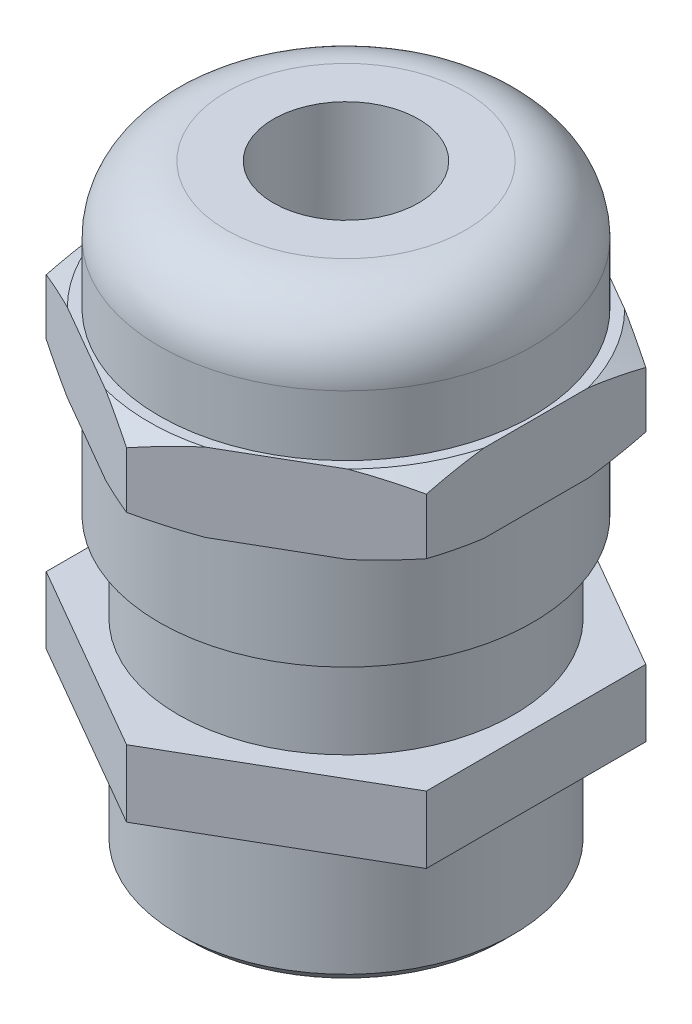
ISO-10303-21;
HEADER;
FILE_DESCRIPTION(('STEP AP214'),'2;1');
FILE_NAME('part.step','',(''),(''),'','','');
FILE_SCHEMA(('AUTOMOTIVE_DESIGN { 1 0 10303 214 1 1 1 1 }'));
ENDSEC;
DATA;
#1=APPLICATION_CONTEXT('core data for automotive mechanical design processes');
#2=APPLICATION_PROTOCOL_DEFINITION('international standard','automotive_design',2000,#1);
#3=PRODUCT_CONTEXT('',#1,'mechanical');
#4=PRODUCT('Part','Part','',(#3));
#5=PRODUCT_RELATED_PRODUCT_CATEGORY('part','',(#4));
#6=PRODUCT_DEFINITION_FORMATION('','',#4);
#7=PRODUCT_DEFINITION_CONTEXT('part definition',#1,'design');
#8=PRODUCT_DEFINITION('design','',#6,#7);
#9=PRODUCT_DEFINITION_SHAPE('','',#8);
#10=(LENGTH_UNIT() NAMED_UNIT(*) SI_UNIT(.MILLI.,.METRE.));
#11=(NAMED_UNIT(*) PLANE_ANGLE_UNIT() SI_UNIT($,.RADIAN.));
#12=(NAMED_UNIT(*) SI_UNIT($,.STERADIAN.) SOLID_ANGLE_UNIT());
#13=UNCERTAINTY_MEASURE_WITH_UNIT(LENGTH_MEASURE(1.E-05),#10,'distance_accuracy_value','');
#14=(GEOMETRIC_REPRESENTATION_CONTEXT(3) GLOBAL_UNCERTAINTY_ASSIGNED_CONTEXT((#13)) GLOBAL_UNIT_ASSIGNED_CONTEXT((#10,
#11,#12)) REPRESENTATION_CONTEXT('',''));
#15=CARTESIAN_POINT('',(0.,0.,0.));
#16=DIRECTION('',(0.,0.,1.));
#17=DIRECTION('',(1.,0.,0.));
#18=AXIS2_PLACEMENT_3D('',#15,#16,#17);
#19=CARTESIAN_POINT('',(0.,20.7,0.));
#20=DIRECTION('',(0.,1.,0.));
#21=DIRECTION('',(0.,0.,1.));
#22=AXIS2_PLACEMENT_3D('',#19,#20,#21);
#23=CYLINDRICAL_SURFACE('',#22,3.25000000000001);
#24=CARTESIAN_POINT('',(0.,20.7,0.));
#25=DIRECTION('',(0.,1.,0.));
#26=DIRECTION('',(0.,0.,1.));
#27=AXIS2_PLACEMENT_3D('',#24,#25,#26);
#28=CIRCLE('',#27,3.25000000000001);
#29=CARTESIAN_POINT('',(0.,20.7,3.25000000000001));
#30=VERTEX_POINT('',#29);
#31=EDGE_CURVE('E379',#30,#30,#28,.T.);
#32=ORIENTED_EDGE('',*,*,#31,.T.);
#33=EDGE_LOOP('',(#32));
#34=FACE_BOUND('',#33,.T.);
#35=CARTESIAN_POINT('',(0.,14.,0.));
#36=DIRECTION('',(0.,-1.,0.));
#37=DIRECTION('',(0.,0.,-1.));
#38=AXIS2_PLACEMENT_3D('',#35,#36,#37);
#39=CIRCLE('',#38,3.25000000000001);
#40=CARTESIAN_POINT('',(0.,14.,-3.25000000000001));
#41=VERTEX_POINT('',#40);
#42=EDGE_CURVE('E36',#41,#41,#39,.F.);
#43=ORIENTED_EDGE('',*,*,#42,.F.);
#44=EDGE_LOOP('',(#43));
#45=FACE_BOUND('',#44,.T.);
#46=ADVANCED_FACE('F32',(#34,#45),#23,.F.);
#47=CARTESIAN_POINT('',(8.5,15.,-4.90747728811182));
#48=DIRECTION('',(1.,0.,0.));
#49=DIRECTION('',(0.,0.,-1.));
#50=AXIS2_PLACEMENT_3D('',#47,#48,#49);
#51=PLANE('',#50);
#52=DIRECTION('',(0.,-1.,0.));
#53=VECTOR('',#52,1.);
#54=CARTESIAN_POINT('',(8.50000000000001,15.,4.90747728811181));
#55=LINE('',#54,#53);
#56=CARTESIAN_POINT('',(8.50000000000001,14.5,4.90747728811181));
#57=VERTEX_POINT('',#56);
#58=CARTESIAN_POINT('',(8.50000000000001,12.,4.90747728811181));
#59=VERTEX_POINT('',#58);
#60=EDGE_CURVE('E231',#57,#59,#55,.T.);
#61=ORIENTED_EDGE('',*,*,#60,.T.);
#62=CARTESIAN_POINT('',(8.50000000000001,13.9660699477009,10.804286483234));
#63=CARTESIAN_POINT('',(8.50000000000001,13.8311262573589,10.4607659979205));
#64=CARTESIAN_POINT('',(8.50000000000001,13.6982273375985,10.116422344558));
#65=CARTESIAN_POINT('',(8.50000000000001,13.4376310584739,9.42569184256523));
#66=CARTESIAN_POINT('',(8.50000000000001,13.3099348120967,9.07930457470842));
#67=CARTESIAN_POINT('',(8.50000000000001,13.0602597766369,8.38240899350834));
#68=CARTESIAN_POINT('',(8.50000000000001,12.9383145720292,8.0318885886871));
#69=CARTESIAN_POINT('',(8.50000000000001,12.7024224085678,7.32817248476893));
#70=CARTESIAN_POINT('',(8.50000000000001,12.5884750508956,6.97497692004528));
#71=CARTESIAN_POINT('',(8.50000000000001,12.3719517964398,6.27022573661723));
#72=CARTESIAN_POINT('',(8.50000000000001,12.2692450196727,5.91871059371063));
#73=CARTESIAN_POINT('',(8.50000000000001,12.0757807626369,5.21236318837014));
#74=CARTESIAN_POINT('',(8.50000000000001,11.9850237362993,4.85753080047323));
#75=CARTESIAN_POINT('',(8.50000000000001,11.8183128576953,4.14502997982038));
#76=CARTESIAN_POINT('',(8.50000000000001,11.742333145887,3.78736766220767));
#77=CARTESIAN_POINT('',(8.50000000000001,11.6079535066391,3.0687673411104));
#78=CARTESIAN_POINT('',(8.50000000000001,11.5495502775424,2.70782996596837));
#79=CARTESIAN_POINT('',(8.50000000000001,11.4621912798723,2.05100641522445));
#80=CARTESIAN_POINT('',(8.50000000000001,11.4297705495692,1.75558270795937));
#81=CARTESIAN_POINT('',(8.50000000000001,11.3796723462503,1.16347998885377));
#82=CARTESIAN_POINT('',(8.50000000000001,11.3619942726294,0.866801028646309));
#83=CARTESIAN_POINT('',(8.50000000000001,11.3421330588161,0.272947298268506));
#84=CARTESIAN_POINT('',(8.50000000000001,11.3399484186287,-0.0242274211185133));
#85=CARTESIAN_POINT('',(8.50000000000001,11.3511656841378,-0.618281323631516));
#86=CARTESIAN_POINT('',(8.50000000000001,11.3645677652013,-0.915160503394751));
#87=CARTESIAN_POINT('',(8.50000000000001,11.4064099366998,-1.50825291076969));
#88=CARTESIAN_POINT('',(8.50000000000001,11.4348705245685,-1.8044646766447));
#89=CARTESIAN_POINT('',(8.50000000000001,11.5057040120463,-2.39519723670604));
#90=CARTESIAN_POINT('',(8.5,11.5480772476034,-2.68971798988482));
#91=CARTESIAN_POINT('',(8.5,11.6939093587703,-3.57043341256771));
#92=CARTESIAN_POINT('',(8.5,11.8160627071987,-4.15355601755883));
#93=CARTESIAN_POINT('',(8.5,12.0830458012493,-5.2514739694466));
#94=CARTESIAN_POINT('',(8.5,12.2242973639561,-5.76717793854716));
#95=CARTESIAN_POINT('',(8.5,12.5287506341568,-6.79191094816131));
#96=CARTESIAN_POINT('',(8.5,12.6919483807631,-7.30094117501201));
#97=CARTESIAN_POINT('',(8.5,12.9484969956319,-8.05940471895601));
#98=CARTESIAN_POINT('',(8.5,13.035800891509,-8.31092184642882));
#99=CARTESIAN_POINT('',(8.5,13.2138594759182,-8.81273824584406));
#100=CARTESIAN_POINT('',(8.5,13.3046142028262,-9.06303750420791));
#101=CARTESIAN_POINT('',(8.5,13.4890271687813,-9.562395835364));
#102=CARTESIAN_POINT('',(8.5,13.5826837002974,-9.81145554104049));
#103=CARTESIAN_POINT('',(8.5,13.7725547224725,-10.3085825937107));
#104=CARTESIAN_POINT('',(8.5,13.8687690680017,-10.5566499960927));
#105=CARTESIAN_POINT('',(8.5,13.9660699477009,-10.8042864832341));
#106=B_SPLINE_CURVE_WITH_KNOTS('',3,(#62,#63,#64,#65,#66,#67,#68,#69,#70,#71,#72,#73,#74,#75,
#76,#77,#78,#79,#80,#81,#82,#83,#84,#85,#86,#87,#88,#89,#90,#91,#92,#93,#94,#95,#96,#97,#98,#99,
#100,#101,#102,#103,#104,#105),.UNSPECIFIED.,.F.,.F.,(4,2,2,2,2,2,2,2,2,2,2,2,2,2,2,2,2,2,2,2,2,
4),(0.,1.1072452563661,2.21472615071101,3.3280288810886,4.44127605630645,5.53974430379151,
6.63825426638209,7.73482424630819,8.8311881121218,9.72244694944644,10.6136694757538,
11.5048057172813,12.3959519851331,13.288314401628,14.1806983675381,15.9661416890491,
17.5696834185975,19.1729361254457,19.9716354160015,20.7703435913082,21.5685903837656,
22.3667919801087),.UNSPECIFIED.);
#107=CARTESIAN_POINT('',(8.50000000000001,11.5,2.3352567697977));
#108=VERTEX_POINT('',#107);
#109=EDGE_CURVE('E492',#59,#108,#106,.T.);
#110=ORIENTED_EDGE('',*,*,#109,.T.);
#111=DIRECTION('',(0.,0.,1.));
#112=VECTOR('',#111,1.);
#113=CARTESIAN_POINT('',(8.5,11.5,-4.90747728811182));
#114=LINE('',#113,#112);
#115=CARTESIAN_POINT('',(8.50000000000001,11.5,-2.33525676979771));
#116=VERTEX_POINT('',#115);
#117=EDGE_CURVE('E373',#116,#108,#114,.T.);
#118=ORIENTED_EDGE('',*,*,#117,.F.);
#119=CARTESIAN_POINT('',(8.5,12.,-4.90747728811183));
#120=VERTEX_POINT('',#119);
#121=EDGE_CURVE('E494',#116,#120,#106,.T.);
#122=ORIENTED_EDGE('',*,*,#121,.T.);
#123=DIRECTION('',(0.,-1.,0.));
#124=VECTOR('',#123,1.);
#125=CARTESIAN_POINT('',(8.5,15.,-4.90747728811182));
#126=LINE('',#125,#124);
#127=CARTESIAN_POINT('',(8.5,14.5,-4.90747728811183));
#128=VERTEX_POINT('',#127);
#129=EDGE_CURVE('E216',#128,#120,#126,.T.);
#130=ORIENTED_EDGE('',*,*,#129,.F.);
#131=CARTESIAN_POINT('',(8.5,12.5339300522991,-10.8042864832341));
#132=CARTESIAN_POINT('',(8.5,12.6688737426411,-10.4607659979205));
#133=CARTESIAN_POINT('',(8.5,12.8017726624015,-10.116422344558));
#134=CARTESIAN_POINT('',(8.5,13.0623689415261,-9.42569184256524));
#135=CARTESIAN_POINT('',(8.5,13.1900651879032,-9.07930457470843));
#136=CARTESIAN_POINT('',(8.5,13.4397402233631,-8.38240899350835));
#137=CARTESIAN_POINT('',(8.5,13.5616854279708,-8.03188858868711));
#138=CARTESIAN_POINT('',(8.5,13.7975775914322,-7.32817248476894));
#139=CARTESIAN_POINT('',(8.5,13.9115249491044,-6.97497692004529));
#140=CARTESIAN_POINT('',(8.5,14.1280482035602,-6.27022573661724));
#141=CARTESIAN_POINT('',(8.5,14.2307549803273,-5.91871059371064));
#142=CARTESIAN_POINT('',(8.5,14.4242192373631,-5.21236318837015));
#143=CARTESIAN_POINT('',(8.5,14.5149762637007,-4.85753080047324));
#144=CARTESIAN_POINT('',(8.5,14.6816871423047,-4.14502997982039));
#145=CARTESIAN_POINT('',(8.5,14.757666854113,-3.78736766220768));
#146=CARTESIAN_POINT('',(8.5,14.8920464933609,-3.06876734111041));
#147=CARTESIAN_POINT('',(8.50000000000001,14.9504497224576,-2.70782996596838));
#148=CARTESIAN_POINT('',(8.50000000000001,15.0378087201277,-2.05100641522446));
#149=CARTESIAN_POINT('',(8.50000000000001,15.0702294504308,-1.75558270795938));
#150=CARTESIAN_POINT('',(8.50000000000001,15.1203276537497,-1.16347998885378));
#151=CARTESIAN_POINT('',(8.50000000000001,15.1380057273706,-0.866801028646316));
#152=CARTESIAN_POINT('',(8.50000000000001,15.1578669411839,-0.272947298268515));
#153=CARTESIAN_POINT('',(8.50000000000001,15.1600515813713,0.0242274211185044));
#154=CARTESIAN_POINT('',(8.50000000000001,15.1488343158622,0.618281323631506));
#155=CARTESIAN_POINT('',(8.50000000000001,15.1354322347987,0.915160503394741));
#156=CARTESIAN_POINT('',(8.50000000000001,15.0935900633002,1.50825291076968));
#157=CARTESIAN_POINT('',(8.50000000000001,15.0651294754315,1.80446467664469));
#158=CARTESIAN_POINT('',(8.50000000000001,14.9942959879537,2.39519723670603));
#159=CARTESIAN_POINT('',(8.50000000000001,14.9519227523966,2.68971798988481));
#160=CARTESIAN_POINT('',(8.50000000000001,14.8060906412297,3.5704334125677));
#161=CARTESIAN_POINT('',(8.50000000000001,14.6839372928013,4.15355601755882));
#162=CARTESIAN_POINT('',(8.50000000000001,14.4169541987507,5.25147396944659));
#163=CARTESIAN_POINT('',(8.50000000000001,14.2757026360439,5.76717793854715));
#164=CARTESIAN_POINT('',(8.50000000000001,13.9712493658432,6.7919109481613));
#165=CARTESIAN_POINT('',(8.50000000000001,13.8080516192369,7.300941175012));
#166=CARTESIAN_POINT('',(8.50000000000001,13.5515030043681,8.059404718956));
#167=CARTESIAN_POINT('',(8.50000000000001,13.464199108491,8.31092184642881));
#168=CARTESIAN_POINT('',(8.50000000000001,13.2861405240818,8.81273824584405));
#169=CARTESIAN_POINT('',(8.50000000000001,13.1953857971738,9.0630375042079));
#170=CARTESIAN_POINT('',(8.50000000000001,13.0109728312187,9.56239583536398));
#171=CARTESIAN_POINT('',(8.50000000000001,12.9173162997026,9.81145554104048));
#172=CARTESIAN_POINT('',(8.50000000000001,12.7274452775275,10.3085825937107));
#173=CARTESIAN_POINT('',(8.50000000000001,12.6312309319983,10.5566499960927));
#174=CARTESIAN_POINT('',(8.50000000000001,12.5339300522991,10.804286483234));
#175=B_SPLINE_CURVE_WITH_KNOTS('',3,(#131,#132,#133,#134,#135,#136,#137,#138,#139,#140,#141,
#142,#143,#144,#145,#146,#147,#148,#149,#150,#151,#152,#153,#154,#155,#156,#157,#158,#159,#160,
#161,#162,#163,#164,#165,#166,#167,#168,#169,#170,#171,#172,#173,#174),.UNSPECIFIED.,.F.,.F.,(4,
2,2,2,2,2,2,2,2,2,2,2,2,2,2,2,2,2,2,2,2,4),(0.,1.10724525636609,2.21472615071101,
3.32802888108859,4.44127605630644,5.53974430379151,6.63825426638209,7.73482424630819,
8.83118811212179,9.72244694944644,10.6136694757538,11.5048057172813,12.3959519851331,
13.288314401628,14.1806983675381,15.9661416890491,17.5696834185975,19.1729361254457,
19.9716354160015,20.7703435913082,21.5685903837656,22.3667919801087),.UNSPECIFIED.);
#176=CARTESIAN_POINT('',(8.50000000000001,15.,-2.33525676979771));
#177=VERTEX_POINT('',#176);
#178=EDGE_CURVE('E382',#128,#177,#175,.T.);
#179=ORIENTED_EDGE('',*,*,#178,.T.);
#180=DIRECTION('',(0.,0.,1.));
#181=VECTOR('',#180,1.);
#182=CARTESIAN_POINT('',(8.5,15.,-4.90747728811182));
#183=LINE('',#182,#181);
#184=CARTESIAN_POINT('',(8.50000000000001,15.,2.3352567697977));
#185=VERTEX_POINT('',#184);
#186=EDGE_CURVE('E358',#177,#185,#183,.T.);
#187=ORIENTED_EDGE('',*,*,#186,.T.);
#188=EDGE_CURVE('E428',#185,#57,#175,.T.);
#189=ORIENTED_EDGE('',*,*,#188,.T.);
#190=EDGE_LOOP('',(#61,#110,#118,#122,#130,#179,#187,#189));
#191=FACE_BOUND('',#190,.T.);
#192=ADVANCED_FACE('F579',(#191),#51,.T.);
#193=CARTESIAN_POINT('',(0.,15.,-9.81495457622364));
#194=DIRECTION('',(0.5,0.,-0.866025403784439));
#195=DIRECTION('',(-0.866025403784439,0.,-0.5));
#196=AXIS2_PLACEMENT_3D('',#193,#194,#195);
#197=PLANE('',#196);
#198=ORIENTED_EDGE('',*,*,#129,.T.);
#199=CARTESIAN_POINT('',(14.3968091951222,14.3300461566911,-1.50295291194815));
#200=CARTESIAN_POINT('',(14.0869036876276,14.1852675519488,-1.6818769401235));
#201=CARTESIAN_POINT('',(13.7763250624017,14.0423703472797,-1.86118959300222));
#202=CARTESIAN_POINT('',(13.1534798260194,13.7613841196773,-2.22078945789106));
#203=CARTESIAN_POINT('',(12.8412129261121,13.623295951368,-2.40107683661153));
#204=CARTESIAN_POINT('',(12.2132868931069,13.3523901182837,-2.76361010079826));
#205=CARTESIAN_POINT('',(11.8976187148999,13.2196002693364,-2.94586120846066));
#206=CARTESIAN_POINT('',(11.2640171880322,12.9614662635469,-3.31167122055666));
#207=CARTESIAN_POINT('',(10.9460839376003,12.8361217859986,-3.4952300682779));
#208=CARTESIAN_POINT('',(10.3108121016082,12.5959734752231,-3.86200443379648));
#209=CARTESIAN_POINT('',(9.99350072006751,12.4810749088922,-4.04520424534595));
#210=CARTESIAN_POINT('',(9.35596635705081,12.2627099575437,-4.41328488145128));
#211=CARTESIAN_POINT('',(9.03574323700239,12.1592441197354,-4.59816578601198));
#212=CARTESIAN_POINT('',(8.07106228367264,11.8704610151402,-5.15512459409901));
#213=CARTESIAN_POINT('',(7.42143995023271,11.7063018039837,-5.53018422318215));
#214=CARTESIAN_POINT('',(6.51389146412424,11.5368371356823,-6.05415758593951));
#215=CARTESIAN_POINT('',(6.26086217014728,11.4959348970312,-6.20024411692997));
#216=CARTESIAN_POINT('',(5.75339867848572,11.4279134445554,-6.49322830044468));
#217=CARTESIAN_POINT('',(5.49896453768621,11.4007936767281,-6.64012592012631));
#218=CARTESIAN_POINT('',(4.98933002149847,11.3614174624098,-6.93436354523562));
#219=CARTESIAN_POINT('',(4.7341299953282,11.3491550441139,-7.08170334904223));
#220=CARTESIAN_POINT('',(4.22351949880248,11.3399961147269,-7.3765044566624));
#221=CARTESIAN_POINT('',(3.96810902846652,11.3430996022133,-7.52396576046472));
#222=CARTESIAN_POINT('',(3.45757444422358,11.3645462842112,-7.81872304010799));
#223=CARTESIAN_POINT('',(3.20245071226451,11.3829014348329,-7.96601879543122));
#224=CARTESIAN_POINT('',(2.69330511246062,11.4341018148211,-8.25997414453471));
#225=CARTESIAN_POINT('',(2.43928326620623,11.4669473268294,-8.40663372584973));
#226=CARTESIAN_POINT('',(1.93264868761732,11.5459129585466,-8.6991393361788));
#227=CARTESIAN_POINT('',(1.68003692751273,11.5920413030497,-8.84498480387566));
#228=CARTESIAN_POINT('',(1.1766310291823,11.6960658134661,-9.13562633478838));
#229=CARTESIAN_POINT('',(0.925837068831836,11.7539631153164,-9.28042229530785));
#230=CARTESIAN_POINT('',(0.393758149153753,11.8881317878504,-9.58761820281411));
#231=CARTESIAN_POINT('',(0.112741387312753,11.9658127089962,-9.74986330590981));
#232=CARTESIAN_POINT('',(-0.446857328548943,12.1320460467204,-10.0729477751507));
#233=CARTESIAN_POINT('',(-0.725439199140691,12.2205988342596,-10.2337870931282));
#234=CARTESIAN_POINT('',(-1.2803924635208,12.4067084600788,-10.5541895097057));
#235=CARTESIAN_POINT('',(-1.5567633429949,12.5042673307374,-10.7137523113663));
#236=CARTESIAN_POINT('',(-2.10746462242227,12.7067843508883,-11.0316998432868));
#237=CARTESIAN_POINT('',(-2.38179494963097,12.8117427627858,-11.1900845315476));
#238=CARTESIAN_POINT('',(-2.92864084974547,13.0277458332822,-11.5058061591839));
#239=CARTESIAN_POINT('',(-3.20115645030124,13.1387903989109,-11.6631431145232));
#240=CARTESIAN_POINT('',(-3.74461271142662,13.3659112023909,-11.9769077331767));
#241=CARTESIAN_POINT('',(-4.015553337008,13.4819875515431,-12.1333353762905));
#242=CARTESIAN_POINT('',(-4.55556822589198,13.7180900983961,-12.4451131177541));
#243=CARTESIAN_POINT('',(-4.82464500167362,13.8381086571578,-12.6004646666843));
#244=CARTESIAN_POINT('',(-5.36158563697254,14.0816278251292,-12.910467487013));
#245=CARTESIAN_POINT('',(-5.62944961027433,14.2051280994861,-13.065118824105));
#246=CARTESIAN_POINT('',(-5.89680919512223,14.3300461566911,-13.2194789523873));
#247=B_SPLINE_CURVE_WITH_KNOTS('',3,(#199,#200,#201,#202,#203,#204,#205,#206,#207,#208,#209,
#210,#211,#212,#213,#214,#215,#216,#217,#218,#219,#220,#221,#222,#223,#224,#225,#226,#227,#228,
#229,#230,#231,#232,#233,#234,#235,#236,#237,#238,#239,#240,#241,#242,#243,#244,#245,#246),
.UNSPECIFIED.,.F.,.F.,(4,2,2,2,2,2,2,2,2,2,2,2,2,2,2,2,2,2,2,2,2,2,2,4),(0.,1.15809462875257,
2.31639402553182,3.48013638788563,4.64382858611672,5.79561329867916,6.94745311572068,
9.24691752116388,10.131722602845,11.0164921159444,11.9009058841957,12.785319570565,
13.6704272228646,14.5555521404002,15.4412263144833,16.3269860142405,17.3277312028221,
18.3285105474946,19.3295162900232,20.3305575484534,21.3315835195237,22.3326316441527,
23.3318428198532,24.3309582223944),.UNSPECIFIED.);
#248=CARTESIAN_POINT('',(6.2723916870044,11.5,-6.19358754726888));
#249=VERTEX_POINT('',#248);
#250=EDGE_CURVE('E210',#120,#249,#247,.T.);
#251=ORIENTED_EDGE('',*,*,#250,.T.);
#252=DIRECTION('',(0.866025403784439,0.,0.5));
#253=VECTOR('',#252,1.);
#254=CARTESIAN_POINT('',(0.,11.5,-9.81495457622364));
#255=LINE('',#254,#253);
#256=CARTESIAN_POINT('',(2.2276083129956,11.5,-8.52884431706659));
#257=VERTEX_POINT('',#256);
#258=EDGE_CURVE('E209',#257,#249,#255,.T.);
#259=ORIENTED_EDGE('',*,*,#258,.F.);
#260=CARTESIAN_POINT('',(0.,12.,-9.81495457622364));
#261=VERTEX_POINT('',#260);
#262=EDGE_CURVE('E49',#257,#261,#247,.T.);
#263=ORIENTED_EDGE('',*,*,#262,.T.);
#264=DIRECTION('',(0.,-1.,0.));
#265=VECTOR('',#264,1.);
#266=CARTESIAN_POINT('',(0.,15.,-9.81495457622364));
#267=LINE('',#266,#265);
#268=CARTESIAN_POINT('',(0.,14.5,-9.81495457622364));
#269=VERTEX_POINT('',#268);
#270=EDGE_CURVE('E206',#269,#261,#267,.T.);
#271=ORIENTED_EDGE('',*,*,#270,.F.);
#272=CARTESIAN_POINT('',(-5.89680919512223,12.1699538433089,-13.2194789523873));
#273=CARTESIAN_POINT('',(-5.58690368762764,12.3147324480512,-13.040554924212));
#274=CARTESIAN_POINT('',(-5.27632506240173,12.4576296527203,-12.8612422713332));
#275=CARTESIAN_POINT('',(-4.65347982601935,12.7386158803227,-12.5016424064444));
#276=CARTESIAN_POINT('',(-4.34121292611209,12.876704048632,-12.3213550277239));
#277=CARTESIAN_POINT('',(-3.71328689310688,13.1476098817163,-11.9588217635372));
#278=CARTESIAN_POINT('',(-3.39761871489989,13.2803997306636,-11.7765706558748));
#279=CARTESIAN_POINT('',(-2.76401718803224,13.5385337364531,-11.4107606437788));
#280=CARTESIAN_POINT('',(-2.44608393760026,13.6638782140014,-11.2272017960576));
#281=CARTESIAN_POINT('',(-1.81081210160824,13.9040265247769,-10.860427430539));
#282=CARTESIAN_POINT('',(-1.4935007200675,14.0189250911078,-10.6772276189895));
#283=CARTESIAN_POINT('',(-0.855966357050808,14.2372900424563,-10.3091469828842));
#284=CARTESIAN_POINT('',(-0.535743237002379,14.3407558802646,-10.1242660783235));
#285=CARTESIAN_POINT('',(0.42893771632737,14.6295389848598,-9.56730727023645));
#286=CARTESIAN_POINT('',(1.07856004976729,14.7936981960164,-9.19224764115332));
#287=CARTESIAN_POINT('',(1.98610853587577,14.9631628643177,-8.66827427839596));
#288=CARTESIAN_POINT('',(2.23913782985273,15.0040651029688,-8.5221877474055));
#289=CARTESIAN_POINT('',(2.74660132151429,15.0720865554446,-8.22920356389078));
#290=CARTESIAN_POINT('',(3.0010354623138,15.0992063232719,-8.08230594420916));
#291=CARTESIAN_POINT('',(3.51066997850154,15.1385825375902,-7.78806831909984));
#292=CARTESIAN_POINT('',(3.76587000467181,15.1508449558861,-7.64072851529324));
#293=CARTESIAN_POINT('',(4.27648050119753,15.1600038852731,-7.34592740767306));
#294=CARTESIAN_POINT('',(4.53189097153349,15.1569003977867,-7.19846610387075));
#295=CARTESIAN_POINT('',(5.04242555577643,15.1354537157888,-6.90370882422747));
#296=CARTESIAN_POINT('',(5.2975492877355,15.1170985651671,-6.75641306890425));
#297=CARTESIAN_POINT('',(5.80669488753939,15.0658981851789,-6.46245771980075));
#298=CARTESIAN_POINT('',(6.06071673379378,15.0330526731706,-6.31579813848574));
#299=CARTESIAN_POINT('',(6.56735131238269,14.9540870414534,-6.02329252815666));
#300=CARTESIAN_POINT('',(6.81996307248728,14.9079586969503,-5.87744706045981));
#301=CARTESIAN_POINT('',(7.32336897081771,14.8039341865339,-5.58680552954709));
#302=CARTESIAN_POINT('',(7.57416293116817,14.7460368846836,-5.44200956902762));
#303=CARTESIAN_POINT('',(8.10624185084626,14.6118682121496,-5.13481366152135));
#304=CARTESIAN_POINT('',(8.38725861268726,14.5341872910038,-4.97256855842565));
#305=CARTESIAN_POINT('',(8.94685732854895,14.3679539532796,-4.64948408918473));
#306=CARTESIAN_POINT('',(9.2254391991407,14.2794011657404,-4.48864477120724));
#307=CARTESIAN_POINT('',(9.7803924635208,14.0932915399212,-4.16824235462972));
#308=CARTESIAN_POINT('',(10.0567633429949,13.9957326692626,-4.00867955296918));
#309=CARTESIAN_POINT('',(10.6074646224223,13.7932156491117,-3.69073202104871));
#310=CARTESIAN_POINT('',(10.881794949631,13.6882572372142,-3.5323473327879));
#311=CARTESIAN_POINT('',(11.4286408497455,13.4722541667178,-3.21662570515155));
#312=CARTESIAN_POINT('',(11.7011564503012,13.3612096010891,-3.0592887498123));
#313=CARTESIAN_POINT('',(12.2446127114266,13.1340887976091,-2.74552413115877));
#314=CARTESIAN_POINT('',(12.515553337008,13.0180124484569,-2.58909648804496));
#315=CARTESIAN_POINT('',(13.055568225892,12.7819099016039,-2.27731874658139));
#316=CARTESIAN_POINT('',(13.3246450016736,12.6618913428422,-2.12196719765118));
#317=CARTESIAN_POINT('',(13.8615856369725,12.4183721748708,-1.8119643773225));
#318=CARTESIAN_POINT('',(14.1294496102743,12.2948719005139,-1.65731304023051));
#319=CARTESIAN_POINT('',(14.3968091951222,12.1699538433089,-1.50295291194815));
#320=B_SPLINE_CURVE_WITH_KNOTS('',3,(#272,#273,#274,#275,#276,#277,#278,#279,#280,#281,#282,
#283,#284,#285,#286,#287,#288,#289,#290,#291,#292,#293,#294,#295,#296,#297,#298,#299,#300,#301,
#302,#303,#304,#305,#306,#307,#308,#309,#310,#311,#312,#313,#314,#315,#316,#317,#318,#319),
.UNSPECIFIED.,.F.,.F.,(4,2,2,2,2,2,2,2,2,2,2,2,2,2,2,2,2,2,2,2,2,2,2,4),(0.,1.15809462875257,
2.31639402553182,3.48013638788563,4.64382858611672,5.79561329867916,6.94745311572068,
9.24691752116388,10.131722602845,11.0164921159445,11.9009058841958,12.785319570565,
13.6704272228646,14.5555521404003,15.4412263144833,16.3269860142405,17.3277312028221,
18.3285105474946,19.3295162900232,20.3305575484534,21.3315835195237,22.3326316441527,
23.3318428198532,24.3309582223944),.UNSPECIFIED.);
#321=CARTESIAN_POINT('',(2.2276083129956,15.,-8.52884431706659));
#322=VERTEX_POINT('',#321);
#323=EDGE_CURVE('E383',#269,#322,#320,.T.);
#324=ORIENTED_EDGE('',*,*,#323,.T.);
#325=DIRECTION('',(0.866025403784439,0.,0.5));
#326=VECTOR('',#325,1.);
#327=CARTESIAN_POINT('',(0.,15.,-9.81495457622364));
#328=LINE('',#327,#326);
#329=CARTESIAN_POINT('',(6.2723916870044,15.,-6.19358754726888));
#330=VERTEX_POINT('',#329);
#331=EDGE_CURVE('E234',#322,#330,#328,.T.);
#332=ORIENTED_EDGE('',*,*,#331,.T.);
#333=EDGE_CURVE('E389',#330,#128,#320,.T.);
#334=ORIENTED_EDGE('',*,*,#333,.T.);
#335=EDGE_LOOP('',(#198,#251,#259,#263,#271,#324,#332,#334));
#336=FACE_BOUND('',#335,.T.);
#337=ADVANCED_FACE('F204',(#336),#197,.T.);
#338=CARTESIAN_POINT('',(-8.5,15.,-4.90747728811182));
#339=DIRECTION('',(-0.5,0.,-0.866025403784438));
#340=DIRECTION('',(-0.866025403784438,0.,0.5));
#341=AXIS2_PLACEMENT_3D('',#338,#339,#340);
#342=PLANE('',#341);
#343=ORIENTED_EDGE('',*,*,#270,.T.);
#344=CARTESIAN_POINT('',(5.89680919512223,14.3300461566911,-13.2194789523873));
#345=CARTESIAN_POINT('',(5.58690368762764,14.1852675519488,-13.040554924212));
#346=CARTESIAN_POINT('',(5.27632506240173,14.0423703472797,-12.8612422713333));
#347=CARTESIAN_POINT('',(4.65347982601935,13.7613841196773,-12.5016424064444));
#348=CARTESIAN_POINT('',(4.34121292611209,13.623295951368,-12.3213550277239));
#349=CARTESIAN_POINT('',(3.71328689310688,13.3523901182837,-11.9588217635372));
#350=CARTESIAN_POINT('',(3.39761871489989,13.2196002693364,-11.7765706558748));
#351=CARTESIAN_POINT('',(2.76401718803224,12.9614662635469,-11.4107606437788));
#352=CARTESIAN_POINT('',(2.44608393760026,12.8361217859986,-11.2272017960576));
#353=CARTESIAN_POINT('',(1.81081210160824,12.5959734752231,-10.860427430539));
#354=CARTESIAN_POINT('',(1.4935007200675,12.4810749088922,-10.6772276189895));
#355=CARTESIAN_POINT('',(0.855966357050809,12.2627099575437,-10.3091469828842));
#356=CARTESIAN_POINT('',(0.535743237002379,12.1592441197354,-10.1242660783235));
#357=CARTESIAN_POINT('',(-0.428937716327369,11.8704610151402,-9.56730727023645));
#358=CARTESIAN_POINT('',(-1.07856004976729,11.7063018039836,-9.19224764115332));
#359=CARTESIAN_POINT('',(-1.98610853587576,11.5368371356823,-8.66827427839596));
#360=CARTESIAN_POINT('',(-2.23913782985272,11.4959348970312,-8.5221877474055));
#361=CARTESIAN_POINT('',(-2.74660132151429,11.4279134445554,-8.22920356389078));
#362=CARTESIAN_POINT('',(-3.0010354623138,11.4007936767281,-8.08230594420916));
#363=CARTESIAN_POINT('',(-3.51066997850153,11.3614174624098,-7.78806831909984));
#364=CARTESIAN_POINT('',(-3.76587000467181,11.3491550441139,-7.64072851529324));
#365=CARTESIAN_POINT('',(-4.27648050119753,11.3399961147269,-7.34592740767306));
#366=CARTESIAN_POINT('',(-4.53189097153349,11.3430996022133,-7.19846610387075));
#367=CARTESIAN_POINT('',(-5.04242555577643,11.3645462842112,-6.90370882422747));
#368=CARTESIAN_POINT('',(-5.29754928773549,11.3829014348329,-6.75641306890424));
#369=CARTESIAN_POINT('',(-5.80669488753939,11.4341018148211,-6.46245771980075));
#370=CARTESIAN_POINT('',(-6.06071673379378,11.4669473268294,-6.31579813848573));
#371=CARTESIAN_POINT('',(-6.56735131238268,11.5459129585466,-6.02329252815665));
#372=CARTESIAN_POINT('',(-6.81996307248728,11.5920413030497,-5.8774470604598));
#373=CARTESIAN_POINT('',(-7.3233689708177,11.6960658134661,-5.58680552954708));
#374=CARTESIAN_POINT('',(-7.57416293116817,11.7539631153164,-5.44200956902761));
#375=CARTESIAN_POINT('',(-8.10624185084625,11.8881317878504,-5.13481366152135));
#376=CARTESIAN_POINT('',(-8.38725861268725,11.9658127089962,-4.97256855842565));
#377=CARTESIAN_POINT('',(-8.94685732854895,12.1320460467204,-4.64948408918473));
#378=CARTESIAN_POINT('',(-9.22543919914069,12.2205988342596,-4.48864477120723));
#379=CARTESIAN_POINT('',(-9.7803924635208,12.4067084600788,-4.16824235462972));
#380=CARTESIAN_POINT('',(-10.0567633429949,12.5042673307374,-4.00867955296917));
#381=CARTESIAN_POINT('',(-10.6074646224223,12.7067843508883,-3.69073202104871));
#382=CARTESIAN_POINT('',(-10.881794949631,12.8117427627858,-3.53234733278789));
#383=CARTESIAN_POINT('',(-11.4286408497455,13.0277458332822,-3.21662570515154));
#384=CARTESIAN_POINT('',(-11.7011564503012,13.1387903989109,-3.05928874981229));
#385=CARTESIAN_POINT('',(-12.2446127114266,13.3659112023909,-2.74552413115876));
#386=CARTESIAN_POINT('',(-12.515553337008,13.4819875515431,-2.58909648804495));
#387=CARTESIAN_POINT('',(-13.055568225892,13.7180900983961,-2.27731874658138));
#388=CARTESIAN_POINT('',(-13.3246450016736,13.8381086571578,-2.12196719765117));
#389=CARTESIAN_POINT('',(-13.8615856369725,14.0816278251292,-1.81196437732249));
#390=CARTESIAN_POINT('',(-14.1294496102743,14.2051280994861,-1.6573130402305));
#391=CARTESIAN_POINT('',(-14.3968091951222,14.3300461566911,-1.50295291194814));
#392=B_SPLINE_CURVE_WITH_KNOTS('',3,(#344,#345,#346,#347,#348,#349,#350,#351,#352,#353,#354,
#355,#356,#357,#358,#359,#360,#361,#362,#363,#364,#365,#366,#367,#368,#369,#370,#371,#372,#373,
#374,#375,#376,#377,#378,#379,#380,#381,#382,#383,#384,#385,#386,#387,#388,#389,#390,#391),
.UNSPECIFIED.,.F.,.F.,(4,2,2,2,2,2,2,2,2,2,2,2,2,2,2,2,2,2,2,2,2,2,2,4),(0.,1.15809462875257,
2.31639402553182,3.48013638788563,4.64382858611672,5.79561329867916,6.94745311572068,
9.24691752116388,10.131722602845,11.0164921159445,11.9009058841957,12.785319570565,
13.6704272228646,14.5555521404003,15.4412263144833,16.3269860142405,17.3277312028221,
18.3285105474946,19.3295162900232,20.3305575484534,21.3315835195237,22.3326316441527,
23.3318428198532,24.3309582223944),.UNSPECIFIED.);
#393=CARTESIAN_POINT('',(-2.22760831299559,11.5,-8.52884431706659));
#394=VERTEX_POINT('',#393);
#395=EDGE_CURVE('E193',#261,#394,#392,.T.);
#396=ORIENTED_EDGE('',*,*,#395,.T.);
#397=DIRECTION('',(0.866025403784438,0.,-0.5));
#398=VECTOR('',#397,1.);
#399=CARTESIAN_POINT('',(-8.5,11.5,-4.90747728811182));
#400=LINE('',#399,#398);
#401=CARTESIAN_POINT('',(-6.27239168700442,11.5,-6.19358754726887));
#402=VERTEX_POINT('',#401);
#403=EDGE_CURVE('E362',#402,#394,#400,.T.);
#404=ORIENTED_EDGE('',*,*,#403,.F.);
#405=CARTESIAN_POINT('',(-8.5,12.,-4.90747728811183));
#406=VERTEX_POINT('',#405);
#407=EDGE_CURVE('E57',#402,#406,#392,.T.);
#408=ORIENTED_EDGE('',*,*,#407,.T.);
#409=DIRECTION('',(0.,-1.,0.));
#410=VECTOR('',#409,1.);
#411=CARTESIAN_POINT('',(-8.5,15.,-4.90747728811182));
#412=LINE('',#411,#410);
#413=CARTESIAN_POINT('',(-8.5,14.5,-4.90747728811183));
#414=VERTEX_POINT('',#413);
#415=EDGE_CURVE('E217',#414,#406,#412,.T.);
#416=ORIENTED_EDGE('',*,*,#415,.F.);
#417=CARTESIAN_POINT('',(-14.3968091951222,12.1699538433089,-1.50295291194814));
#418=CARTESIAN_POINT('',(-14.0869036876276,12.3147324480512,-1.68187694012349));
#419=CARTESIAN_POINT('',(-13.7763250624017,12.4576296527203,-1.86118959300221));
#420=CARTESIAN_POINT('',(-13.1534798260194,12.7386158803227,-2.22078945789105));
#421=CARTESIAN_POINT('',(-12.8412129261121,12.876704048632,-2.40107683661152));
#422=CARTESIAN_POINT('',(-12.2132868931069,13.1476098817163,-2.76361010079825));
#423=CARTESIAN_POINT('',(-11.8976187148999,13.2803997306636,-2.94586120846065));
#424=CARTESIAN_POINT('',(-11.2640171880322,13.5385337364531,-3.31167122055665));
#425=CARTESIAN_POINT('',(-10.9460839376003,13.6638782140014,-3.49523006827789));
#426=CARTESIAN_POINT('',(-10.3108121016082,13.9040265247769,-3.86200443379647));
#427=CARTESIAN_POINT('',(-9.99350072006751,14.0189250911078,-4.04520424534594));
#428=CARTESIAN_POINT('',(-9.35596635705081,14.2372900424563,-4.41328488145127));
#429=CARTESIAN_POINT('',(-9.03574323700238,14.3407558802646,-4.59816578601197));
#430=CARTESIAN_POINT('',(-8.07106228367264,14.6295389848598,-5.15512459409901));
#431=CARTESIAN_POINT('',(-7.42143995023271,14.7936981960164,-5.53018422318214));
#432=CARTESIAN_POINT('',(-6.51389146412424,14.9631628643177,-6.0541575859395));
#433=CARTESIAN_POINT('',(-6.26086217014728,15.0040651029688,-6.20024411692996));
#434=CARTESIAN_POINT('',(-5.75339867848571,15.0720865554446,-6.49322830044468));
#435=CARTESIAN_POINT('',(-5.4989645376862,15.0992063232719,-6.6401259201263));
#436=CARTESIAN_POINT('',(-4.98933002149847,15.1385825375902,-6.93436354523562));
#437=CARTESIAN_POINT('',(-4.7341299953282,15.1508449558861,-7.08170334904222));
#438=CARTESIAN_POINT('',(-4.22351949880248,15.1600038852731,-7.3765044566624));
#439=CARTESIAN_POINT('',(-3.96810902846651,15.1569003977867,-7.52396576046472));
#440=CARTESIAN_POINT('',(-3.45757444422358,15.1354537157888,-7.81872304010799));
#441=CARTESIAN_POINT('',(-3.20245071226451,15.1170985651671,-7.96601879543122));
#442=CARTESIAN_POINT('',(-2.69330511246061,15.0658981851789,-8.25997414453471));
#443=CARTESIAN_POINT('',(-2.43928326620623,15.0330526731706,-8.40663372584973));
#444=CARTESIAN_POINT('',(-1.93264868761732,14.9540870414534,-8.6991393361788));
#445=CARTESIAN_POINT('',(-1.68003692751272,14.9079586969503,-8.84498480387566));
#446=CARTESIAN_POINT('',(-1.1766310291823,14.8039341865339,-9.13562633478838));
#447=CARTESIAN_POINT('',(-0.925837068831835,14.7460368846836,-9.28042229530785));
#448=CARTESIAN_POINT('',(-0.393758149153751,14.6118682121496,-9.58761820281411));
#449=CARTESIAN_POINT('',(-0.11274138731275,14.5341872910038,-9.74986330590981));
#450=CARTESIAN_POINT('',(0.446857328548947,14.3679539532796,-10.0729477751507));
#451=CARTESIAN_POINT('',(0.725439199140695,14.2794011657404,-10.2337870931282));
#452=CARTESIAN_POINT('',(1.2803924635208,14.0932915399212,-10.5541895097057));
#453=CARTESIAN_POINT('',(1.55676334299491,13.9957326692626,-10.7137523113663));
#454=CARTESIAN_POINT('',(2.10746462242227,13.7932156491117,-11.0316998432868));
#455=CARTESIAN_POINT('',(2.38179494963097,13.6882572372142,-11.1900845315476));
#456=CARTESIAN_POINT('',(2.92864084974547,13.4722541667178,-11.5058061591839));
#457=CARTESIAN_POINT('',(3.20115645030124,13.3612096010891,-11.6631431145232));
#458=CARTESIAN_POINT('',(3.74461271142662,13.1340887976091,-11.9769077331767));
#459=CARTESIAN_POINT('',(4.015553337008,13.0180124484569,-12.1333353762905));
#460=CARTESIAN_POINT('',(4.55556822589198,12.7819099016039,-12.4451131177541));
#461=CARTESIAN_POINT('',(4.82464500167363,12.6618913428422,-12.6004646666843));
#462=CARTESIAN_POINT('',(5.36158563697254,12.4183721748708,-12.910467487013));
#463=CARTESIAN_POINT('',(5.62944961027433,12.2948719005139,-13.065118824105));
#464=CARTESIAN_POINT('',(5.89680919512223,12.1699538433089,-13.2194789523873));
#465=B_SPLINE_CURVE_WITH_KNOTS('',3,(#417,#418,#419,#420,#421,#422,#423,#424,#425,#426,#427,
#428,#429,#430,#431,#432,#433,#434,#435,#436,#437,#438,#439,#440,#441,#442,#443,#444,#445,#446,
#447,#448,#449,#450,#451,#452,#453,#454,#455,#456,#457,#458,#459,#460,#461,#462,#463,#464),
.UNSPECIFIED.,.F.,.F.,(4,2,2,2,2,2,2,2,2,2,2,2,2,2,2,2,2,2,2,2,2,2,2,4),(0.,1.15809462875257,
2.31639402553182,3.48013638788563,4.64382858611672,5.79561329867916,6.94745311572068,
9.24691752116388,10.131722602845,11.0164921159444,11.9009058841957,12.785319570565,
13.6704272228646,14.5555521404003,15.4412263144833,16.3269860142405,17.3277312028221,
18.3285105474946,19.3295162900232,20.3305575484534,21.3315835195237,22.3326316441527,
23.3318428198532,24.3309582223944),.UNSPECIFIED.);
#466=CARTESIAN_POINT('',(-6.27239168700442,15.,-6.19358754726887));
#467=VERTEX_POINT('',#466);
#468=EDGE_CURVE('E334',#414,#467,#465,.T.);
#469=ORIENTED_EDGE('',*,*,#468,.T.);
#470=DIRECTION('',(0.866025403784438,0.,-0.5));
#471=VECTOR('',#470,1.);
#472=CARTESIAN_POINT('',(-8.5,15.,-4.90747728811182));
#473=LINE('',#472,#471);
#474=CARTESIAN_POINT('',(-2.22760831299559,15.,-8.52884431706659));
#475=VERTEX_POINT('',#474);
#476=EDGE_CURVE('E342',#467,#475,#473,.T.);
#477=ORIENTED_EDGE('',*,*,#476,.T.);
#478=EDGE_CURVE('E215',#475,#269,#465,.T.);
#479=ORIENTED_EDGE('',*,*,#478,.T.);
#480=EDGE_LOOP('',(#343,#396,#404,#408,#416,#469,#477,#479));
#481=FACE_BOUND('',#480,.T.);
#482=ADVANCED_FACE('F213',(#481),#342,.T.);
#483=CARTESIAN_POINT('',(-8.5,15.,4.90747728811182));
#484=DIRECTION('',(-1.,0.,0.));
#485=DIRECTION('',(0.,0.,1.));
#486=AXIS2_PLACEMENT_3D('',#483,#484,#485);
#487=PLANE('',#486);
#488=ORIENTED_EDGE('',*,*,#415,.T.);
#489=CARTESIAN_POINT('',(-8.5,13.9660699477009,-10.804286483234));
#490=CARTESIAN_POINT('',(-8.5,13.8311262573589,-10.4607659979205));
#491=CARTESIAN_POINT('',(-8.5,13.6982273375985,-10.116422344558));
#492=CARTESIAN_POINT('',(-8.5,13.4376310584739,-9.42569184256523));
#493=CARTESIAN_POINT('',(-8.5,13.3099348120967,-9.07930457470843));
#494=CARTESIAN_POINT('',(-8.5,13.0602597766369,-8.38240899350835));
#495=CARTESIAN_POINT('',(-8.5,12.9383145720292,-8.03188858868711));
#496=CARTESIAN_POINT('',(-8.5,12.7024224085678,-7.32817248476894));
#497=CARTESIAN_POINT('',(-8.5,12.5884750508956,-6.97497692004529));
#498=CARTESIAN_POINT('',(-8.5,12.3719517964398,-6.27022573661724));
#499=CARTESIAN_POINT('',(-8.5,12.2692450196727,-5.91871059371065));
#500=CARTESIAN_POINT('',(-8.5,12.0757807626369,-5.21236318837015));
#501=CARTESIAN_POINT('',(-8.5,11.9850237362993,-4.85753080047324));
#502=CARTESIAN_POINT('',(-8.5,11.8183128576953,-4.14502997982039));
#503=CARTESIAN_POINT('',(-8.5,11.742333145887,-3.78736766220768));
#504=CARTESIAN_POINT('',(-8.5,11.6079535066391,-3.06876734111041));
#505=CARTESIAN_POINT('',(-8.5,11.5495502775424,-2.70782996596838));
#506=CARTESIAN_POINT('',(-8.5,11.4621912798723,-2.05100641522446));
#507=CARTESIAN_POINT('',(-8.5,11.4297705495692,-1.75558270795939));
#508=CARTESIAN_POINT('',(-8.5,11.3796723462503,-1.16347998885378));
#509=CARTESIAN_POINT('',(-8.5,11.3619942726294,-0.866801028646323));
#510=CARTESIAN_POINT('',(-8.5,11.3421330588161,-0.272947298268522));
#511=CARTESIAN_POINT('',(-8.5,11.3399484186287,0.0242274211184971));
#512=CARTESIAN_POINT('',(-8.5,11.3511656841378,0.618281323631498));
#513=CARTESIAN_POINT('',(-8.5,11.3645677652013,0.915160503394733));
#514=CARTESIAN_POINT('',(-8.5,11.4064099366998,1.50825291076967));
#515=CARTESIAN_POINT('',(-8.5,11.4348705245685,1.80446467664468));
#516=CARTESIAN_POINT('',(-8.5,11.5057040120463,2.39519723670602));
#517=CARTESIAN_POINT('',(-8.5,11.5480772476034,2.6897179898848));
#518=CARTESIAN_POINT('',(-8.5,11.6939093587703,3.57043341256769));
#519=CARTESIAN_POINT('',(-8.5,11.8160627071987,4.15355601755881));
#520=CARTESIAN_POINT('',(-8.5,12.0830458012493,5.25147396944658));
#521=CARTESIAN_POINT('',(-8.5,12.2242973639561,5.76717793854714));
#522=CARTESIAN_POINT('',(-8.5,12.5287506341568,6.7919109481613));
#523=CARTESIAN_POINT('',(-8.5,12.6919483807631,7.300941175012));
#524=CARTESIAN_POINT('',(-8.5,12.9484969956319,8.059404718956));
#525=CARTESIAN_POINT('',(-8.5,13.035800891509,8.31092184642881));
#526=CARTESIAN_POINT('',(-8.5,13.2138594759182,8.81273824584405));
#527=CARTESIAN_POINT('',(-8.5,13.3046142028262,9.0630375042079));
#528=CARTESIAN_POINT('',(-8.5,13.4890271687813,9.56239583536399));
#529=CARTESIAN_POINT('',(-8.5,13.5826837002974,9.81145554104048));
#530=CARTESIAN_POINT('',(-8.5,13.7725547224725,10.3085825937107));
#531=CARTESIAN_POINT('',(-8.5,13.8687690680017,10.5566499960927));
#532=CARTESIAN_POINT('',(-8.5,13.9660699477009,10.804286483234));
#533=B_SPLINE_CURVE_WITH_KNOTS('',3,(#489,#490,#491,#492,#493,#494,#495,#496,#497,#498,#499,
#500,#501,#502,#503,#504,#505,#506,#507,#508,#509,#510,#511,#512,#513,#514,#515,#516,#517,#518,
#519,#520,#521,#522,#523,#524,#525,#526,#527,#528,#529,#530,#531,#532),.UNSPECIFIED.,.F.,.F.,(4,
2,2,2,2,2,2,2,2,2,2,2,2,2,2,2,2,2,2,2,2,4),(0.,1.10724525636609,2.21472615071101,
3.32802888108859,4.44127605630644,5.5397443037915,6.63825426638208,7.73482424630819,
8.83118811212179,9.72244694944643,10.6136694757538,11.5048057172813,12.3959519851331,
13.288314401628,14.1806983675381,15.9661416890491,17.5696834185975,19.1729361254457,
19.9716354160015,20.7703435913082,21.5685903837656,22.3667919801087),.UNSPECIFIED.);
#534=CARTESIAN_POINT('',(-8.5,11.5,-2.33525676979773));
#535=VERTEX_POINT('',#534);
#536=EDGE_CURVE('E454',#406,#535,#533,.T.);
#537=ORIENTED_EDGE('',*,*,#536,.T.);
#538=DIRECTION('',(0.,0.,-1.));
#539=VECTOR('',#538,1.);
#540=CARTESIAN_POINT('',(-8.5,11.5,4.90747728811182));
#541=LINE('',#540,#539);
#542=CARTESIAN_POINT('',(-8.5,11.5,2.33525676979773));
#543=VERTEX_POINT('',#542);
#544=EDGE_CURVE('E364',#543,#535,#541,.T.);
#545=ORIENTED_EDGE('',*,*,#544,.F.);
#546=CARTESIAN_POINT('',(-8.50000000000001,12.,4.90747728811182));
#547=VERTEX_POINT('',#546);
#548=EDGE_CURVE('E448',#543,#547,#533,.T.);
#549=ORIENTED_EDGE('',*,*,#548,.T.);
#550=DIRECTION('',(0.,-1.,0.));
#551=VECTOR('',#550,1.);
#552=CARTESIAN_POINT('',(-8.5,15.,4.90747728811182));
#553=LINE('',#552,#551);
#554=CARTESIAN_POINT('',(-8.50000000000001,14.5,4.90747728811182));
#555=VERTEX_POINT('',#554);
#556=EDGE_CURVE('E222',#555,#547,#553,.T.);
#557=ORIENTED_EDGE('',*,*,#556,.F.);
#558=CARTESIAN_POINT('',(-8.5,12.5339300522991,10.804286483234));
#559=CARTESIAN_POINT('',(-8.5,12.6688737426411,10.4607659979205));
#560=CARTESIAN_POINT('',(-8.5,12.8017726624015,10.116422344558));
#561=CARTESIAN_POINT('',(-8.5,13.0623689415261,9.42569184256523));
#562=CARTESIAN_POINT('',(-8.5,13.1900651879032,9.07930457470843));
#563=CARTESIAN_POINT('',(-8.5,13.4397402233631,8.38240899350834));
#564=CARTESIAN_POINT('',(-8.5,13.5616854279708,8.03188858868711));
#565=CARTESIAN_POINT('',(-8.5,13.7975775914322,7.32817248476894));
#566=CARTESIAN_POINT('',(-8.5,13.9115249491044,6.97497692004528));
#567=CARTESIAN_POINT('',(-8.5,14.1280482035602,6.27022573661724));
#568=CARTESIAN_POINT('',(-8.5,14.2307549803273,5.91871059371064));
#569=CARTESIAN_POINT('',(-8.5,14.4242192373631,5.21236318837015));
#570=CARTESIAN_POINT('',(-8.5,14.5149762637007,4.85753080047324));
#571=CARTESIAN_POINT('',(-8.5,14.6816871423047,4.14502997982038));
#572=CARTESIAN_POINT('',(-8.5,14.757666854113,3.78736766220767));
#573=CARTESIAN_POINT('',(-8.5,14.8920464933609,3.06876734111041));
#574=CARTESIAN_POINT('',(-8.5,14.9504497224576,2.70782996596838));
#575=CARTESIAN_POINT('',(-8.5,15.0378087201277,2.05100641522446));
#576=CARTESIAN_POINT('',(-8.5,15.0702294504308,1.75558270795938));
#577=CARTESIAN_POINT('',(-8.5,15.1203276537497,1.16347998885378));
#578=CARTESIAN_POINT('',(-8.5,15.1380057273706,0.86680102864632));
#579=CARTESIAN_POINT('',(-8.5,15.1578669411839,0.27294729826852));
#580=CARTESIAN_POINT('',(-8.5,15.1600515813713,-0.0242274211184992));
#581=CARTESIAN_POINT('',(-8.5,15.1488343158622,-0.6182813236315));
#582=CARTESIAN_POINT('',(-8.5,15.1354322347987,-0.915160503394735));
#583=CARTESIAN_POINT('',(-8.5,15.0935900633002,-1.50825291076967));
#584=CARTESIAN_POINT('',(-8.5,15.0651294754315,-1.80446467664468));
#585=CARTESIAN_POINT('',(-8.5,14.9942959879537,-2.39519723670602));
#586=CARTESIAN_POINT('',(-8.5,14.9519227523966,-2.6897179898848));
#587=CARTESIAN_POINT('',(-8.5,14.8060906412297,-3.5704334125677));
#588=CARTESIAN_POINT('',(-8.5,14.6839372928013,-4.15355601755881));
#589=CARTESIAN_POINT('',(-8.5,14.4169541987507,-5.25147396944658));
#590=CARTESIAN_POINT('',(-8.5,14.2757026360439,-5.76717793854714));
#591=CARTESIAN_POINT('',(-8.5,13.9712493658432,-6.7919109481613));
#592=CARTESIAN_POINT('',(-8.5,13.8080516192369,-7.300941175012));
#593=CARTESIAN_POINT('',(-8.5,13.5515030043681,-8.059404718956));
#594=CARTESIAN_POINT('',(-8.5,13.464199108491,-8.31092184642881));
#595=CARTESIAN_POINT('',(-8.5,13.2861405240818,-8.81273824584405));
#596=CARTESIAN_POINT('',(-8.5,13.1953857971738,-9.0630375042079));
#597=CARTESIAN_POINT('',(-8.5,13.0109728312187,-9.56239583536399));
#598=CARTESIAN_POINT('',(-8.5,12.9173162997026,-9.81145554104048));
#599=CARTESIAN_POINT('',(-8.5,12.7274452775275,-10.3085825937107));
#600=CARTESIAN_POINT('',(-8.5,12.6312309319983,-10.5566499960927));
#601=CARTESIAN_POINT('',(-8.5,12.5339300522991,-10.804286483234));
#602=B_SPLINE_CURVE_WITH_KNOTS('',3,(#558,#559,#560,#561,#562,#563,#564,#565,#566,#567,#568,
#569,#570,#571,#572,#573,#574,#575,#576,#577,#578,#579,#580,#581,#582,#583,#584,#585,#586,#587,
#588,#589,#590,#591,#592,#593,#594,#595,#596,#597,#598,#599,#600,#601),.UNSPECIFIED.,.F.,.F.,(4,
2,2,2,2,2,2,2,2,2,2,2,2,2,2,2,2,2,2,2,2,4),(0.,1.10724525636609,2.21472615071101,
3.3280288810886,4.44127605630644,5.53974430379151,6.63825426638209,7.73482424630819,
8.83118811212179,9.72244694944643,10.6136694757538,11.5048057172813,12.3959519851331,
13.288314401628,14.1806983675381,15.9661416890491,17.5696834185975,19.1729361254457,
19.9716354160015,20.7703435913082,21.5685903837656,22.3667919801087),.UNSPECIFIED.);
#603=CARTESIAN_POINT('',(-8.5,15.,2.33525676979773));
#604=VERTEX_POINT('',#603);
#605=EDGE_CURVE('E433',#555,#604,#602,.T.);
#606=ORIENTED_EDGE('',*,*,#605,.T.);
#607=DIRECTION('',(0.,0.,-1.));
#608=VECTOR('',#607,1.);
#609=CARTESIAN_POINT('',(-8.5,15.,4.90747728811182));
#610=LINE('',#609,#608);
#611=CARTESIAN_POINT('',(-8.5,15.,-2.33525676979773));
#612=VERTEX_POINT('',#611);
#613=EDGE_CURVE('E347',#604,#612,#610,.T.);
#614=ORIENTED_EDGE('',*,*,#613,.T.);
#615=EDGE_CURVE('E336',#612,#414,#602,.T.);
#616=ORIENTED_EDGE('',*,*,#615,.T.);
#617=EDGE_LOOP('',(#488,#537,#545,#549,#557,#606,#614,#616));
#618=FACE_BOUND('',#617,.T.);
#619=ADVANCED_FACE('F439',(#618),#487,.T.);
#620=CARTESIAN_POINT('',(0.,15.,9.81495457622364));
#621=DIRECTION('',(-0.5,0.,0.866025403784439));
#622=DIRECTION('',(0.866025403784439,0.,0.5));
#623=AXIS2_PLACEMENT_3D('',#620,#621,#622);
#624=PLANE('',#623);
#625=ORIENTED_EDGE('',*,*,#556,.T.);
#626=CARTESIAN_POINT('',(-14.3968091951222,14.3300461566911,1.50295291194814));
#627=CARTESIAN_POINT('',(-14.0869036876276,14.1852675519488,1.68187694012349));
#628=CARTESIAN_POINT('',(-13.7763250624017,14.0423703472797,1.86118959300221));
#629=CARTESIAN_POINT('',(-13.1534798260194,13.7613841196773,2.22078945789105));
#630=CARTESIAN_POINT('',(-12.8412129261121,13.623295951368,2.40107683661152));
#631=CARTESIAN_POINT('',(-12.2132868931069,13.3523901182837,2.76361010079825));
#632=CARTESIAN_POINT('',(-11.8976187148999,13.2196002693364,2.94586120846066));
#633=CARTESIAN_POINT('',(-11.2640171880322,12.9614662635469,3.31167122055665));
#634=CARTESIAN_POINT('',(-10.9460839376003,12.8361217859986,3.49523006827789));
#635=CARTESIAN_POINT('',(-10.3108121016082,12.5959734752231,3.86200443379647));
#636=CARTESIAN_POINT('',(-9.99350072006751,12.4810749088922,4.04520424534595));
#637=CARTESIAN_POINT('',(-9.35596635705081,12.2627099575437,4.41328488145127));
#638=CARTESIAN_POINT('',(-9.03574323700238,12.1592441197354,4.59816578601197));
#639=CARTESIAN_POINT('',(-8.07106228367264,11.8704610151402,5.15512459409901));
#640=CARTESIAN_POINT('',(-7.42143995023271,11.7063018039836,5.53018422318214));
#641=CARTESIAN_POINT('',(-6.51389146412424,11.5368371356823,6.0541575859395));
#642=CARTESIAN_POINT('',(-6.26086217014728,11.4959348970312,6.20024411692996));
#643=CARTESIAN_POINT('',(-5.75339867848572,11.4279134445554,6.49322830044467));
#644=CARTESIAN_POINT('',(-5.49896453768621,11.4007936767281,6.6401259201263));
#645=CARTESIAN_POINT('',(-4.98933002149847,11.3614174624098,6.93436354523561));
#646=CARTESIAN_POINT('',(-4.7341299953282,11.3491550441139,7.08170334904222));
#647=CARTESIAN_POINT('',(-4.22351949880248,11.3399961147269,7.37650445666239));
#648=CARTESIAN_POINT('',(-3.96810902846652,11.3430996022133,7.52396576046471));
#649=CARTESIAN_POINT('',(-3.45757444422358,11.3645462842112,7.81872304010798));
#650=CARTESIAN_POINT('',(-3.20245071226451,11.3829014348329,7.96601879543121));
#651=CARTESIAN_POINT('',(-2.69330511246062,11.4341018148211,8.25997414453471));
#652=CARTESIAN_POINT('',(-2.43928326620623,11.4669473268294,8.40663372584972));
#653=CARTESIAN_POINT('',(-1.93264868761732,11.5459129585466,8.6991393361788));
#654=CARTESIAN_POINT('',(-1.68003692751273,11.5920413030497,8.84498480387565));
#655=CARTESIAN_POINT('',(-1.1766310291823,11.6960658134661,9.13562633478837));
#656=CARTESIAN_POINT('',(-0.925837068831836,11.7539631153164,9.28042229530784));
#657=CARTESIAN_POINT('',(-0.393758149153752,11.8881317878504,9.58761820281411));
#658=CARTESIAN_POINT('',(-0.11274138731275,11.9658127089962,9.74986330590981));
#659=CARTESIAN_POINT('',(0.446857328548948,12.1320460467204,10.0729477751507));
#660=CARTESIAN_POINT('',(0.725439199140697,12.2205988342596,10.2337870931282));
#661=CARTESIAN_POINT('',(1.2803924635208,12.4067084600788,10.5541895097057));
#662=CARTESIAN_POINT('',(1.55676334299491,12.5042673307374,10.7137523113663));
#663=CARTESIAN_POINT('',(2.10746462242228,12.7067843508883,11.0316998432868));
#664=CARTESIAN_POINT('',(2.38179494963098,12.8117427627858,11.1900845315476));
#665=CARTESIAN_POINT('',(2.92864084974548,13.0277458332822,11.5058061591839));
#666=CARTESIAN_POINT('',(3.20115645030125,13.1387903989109,11.6631431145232));
#667=CARTESIAN_POINT('',(3.74461271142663,13.3659112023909,11.9769077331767));
#668=CARTESIAN_POINT('',(4.01555333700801,13.4819875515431,12.1333353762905));
#669=CARTESIAN_POINT('',(4.55556822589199,13.7180900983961,12.4451131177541));
#670=CARTESIAN_POINT('',(4.82464500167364,13.8381086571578,12.6004646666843));
#671=CARTESIAN_POINT('',(5.36158563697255,14.0816278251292,12.910467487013));
#672=CARTESIAN_POINT('',(5.62944961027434,14.2051280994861,13.065118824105));
#673=CARTESIAN_POINT('',(5.89680919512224,14.3300461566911,13.2194789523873));
#674=B_SPLINE_CURVE_WITH_KNOTS('',3,(#626,#627,#628,#629,#630,#631,#632,#633,#634,#635,#636,
#637,#638,#639,#640,#641,#642,#643,#644,#645,#646,#647,#648,#649,#650,#651,#652,#653,#654,#655,
#656,#657,#658,#659,#660,#661,#662,#663,#664,#665,#666,#667,#668,#669,#670,#671,#672,#673),
.UNSPECIFIED.,.F.,.F.,(4,2,2,2,2,2,2,2,2,2,2,2,2,2,2,2,2,2,2,2,2,2,2,4),(0.,1.15809462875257,
2.31639402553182,3.48013638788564,4.64382858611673,5.79561329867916,6.94745311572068,
9.24691752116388,10.131722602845,11.0164921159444,11.9009058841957,12.785319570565,
13.6704272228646,14.5555521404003,15.4412263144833,16.3269860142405,17.3277312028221,
18.3285105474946,19.3295162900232,20.3305575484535,21.3315835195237,22.3326316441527,
23.3318428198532,24.3309582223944),.UNSPECIFIED.);
#675=CARTESIAN_POINT('',(-6.27239168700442,11.5,6.19358754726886));
#676=VERTEX_POINT('',#675);
#677=EDGE_CURVE('E455',#547,#676,#674,.T.);
#678=ORIENTED_EDGE('',*,*,#677,.T.);
#679=DIRECTION('',(-0.866025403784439,0.,-0.5));
#680=VECTOR('',#679,1.);
#681=CARTESIAN_POINT('',(0.,11.5,9.81495457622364));
#682=LINE('',#681,#680);
#683=CARTESIAN_POINT('',(-2.22760831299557,11.5,8.52884431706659));
#684=VERTEX_POINT('',#683);
#685=EDGE_CURVE('E367',#684,#676,#682,.T.);
#686=ORIENTED_EDGE('',*,*,#685,.F.);
#687=CARTESIAN_POINT('',(0.,12.,9.81495457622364));
#688=VERTEX_POINT('',#687);
#689=EDGE_CURVE('E456',#684,#688,#674,.T.);
#690=ORIENTED_EDGE('',*,*,#689,.T.);
#691=DIRECTION('',(0.,-1.,0.));
#692=VECTOR('',#691,1.);
#693=CARTESIAN_POINT('',(0.,15.,9.81495457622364));
#694=LINE('',#693,#692);
#695=CARTESIAN_POINT('',(0.,14.5,9.81495457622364));
#696=VERTEX_POINT('',#695);
#697=EDGE_CURVE('E228',#696,#688,#694,.T.);
#698=ORIENTED_EDGE('',*,*,#697,.F.);
#699=CARTESIAN_POINT('',(5.89680919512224,12.1699538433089,13.2194789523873));
#700=CARTESIAN_POINT('',(5.58690368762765,12.3147324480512,13.040554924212));
#701=CARTESIAN_POINT('',(5.27632506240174,12.4576296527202,12.8612422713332));
#702=CARTESIAN_POINT('',(4.65347982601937,12.7386158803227,12.5016424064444));
#703=CARTESIAN_POINT('',(4.3412129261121,12.876704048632,12.3213550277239));
#704=CARTESIAN_POINT('',(3.7132868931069,13.1476098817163,11.9588217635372));
#705=CARTESIAN_POINT('',(3.39761871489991,13.2803997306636,11.7765706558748));
#706=CARTESIAN_POINT('',(2.76401718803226,13.5385337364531,11.4107606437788));
#707=CARTESIAN_POINT('',(2.44608393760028,13.6638782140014,11.2272017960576));
#708=CARTESIAN_POINT('',(1.81081210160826,13.9040265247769,10.860427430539));
#709=CARTESIAN_POINT('',(1.49350072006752,14.0189250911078,10.6772276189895));
#710=CARTESIAN_POINT('',(0.855966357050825,14.2372900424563,10.3091469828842));
#711=CARTESIAN_POINT('',(0.535743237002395,14.3407558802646,10.1242660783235));
#712=CARTESIAN_POINT('',(-0.428937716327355,14.6295389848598,9.56730727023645));
#713=CARTESIAN_POINT('',(-1.07856004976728,14.7936981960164,9.19224764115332));
#714=CARTESIAN_POINT('',(-1.98610853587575,14.9631628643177,8.66827427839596));
#715=CARTESIAN_POINT('',(-2.23913782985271,15.0040651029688,8.5221877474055));
#716=CARTESIAN_POINT('',(-2.74660132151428,15.0720865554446,8.22920356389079));
#717=CARTESIAN_POINT('',(-3.00103546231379,15.0992063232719,8.08230594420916));
#718=CARTESIAN_POINT('',(-3.51066997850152,15.1385825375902,7.78806831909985));
#719=CARTESIAN_POINT('',(-3.76587000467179,15.1508449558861,7.64072851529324));
#720=CARTESIAN_POINT('',(-4.27648050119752,15.1600038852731,7.34592740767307));
#721=CARTESIAN_POINT('',(-4.53189097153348,15.1569003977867,7.19846610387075));
#722=CARTESIAN_POINT('',(-5.04242555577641,15.1354537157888,6.90370882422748));
#723=CARTESIAN_POINT('',(-5.29754928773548,15.1170985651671,6.75641306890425));
#724=CARTESIAN_POINT('',(-5.80669488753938,15.0658981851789,6.46245771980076));
#725=CARTESIAN_POINT('',(-6.06071673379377,15.0330526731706,6.31579813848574));
#726=CARTESIAN_POINT('',(-6.56735131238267,14.9540870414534,6.02329252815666));
#727=CARTESIAN_POINT('',(-6.81996307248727,14.9079586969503,5.87744706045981));
#728=CARTESIAN_POINT('',(-7.32336897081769,14.8039341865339,5.58680552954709));
#729=CARTESIAN_POINT('',(-7.57416293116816,14.7460368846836,5.44200956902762));
#730=CARTESIAN_POINT('',(-8.10624185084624,14.6118682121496,5.13481366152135));
#731=CARTESIAN_POINT('',(-8.38725861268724,14.5341872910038,4.97256855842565));
#732=CARTESIAN_POINT('',(-8.94685732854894,14.3679539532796,4.64948408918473));
#733=CARTESIAN_POINT('',(-9.22543919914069,14.2794011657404,4.48864477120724));
#734=CARTESIAN_POINT('',(-9.78039246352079,14.0932915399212,4.16824235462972));
#735=CARTESIAN_POINT('',(-10.0567633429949,13.9957326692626,4.00867955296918));
#736=CARTESIAN_POINT('',(-10.6074646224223,13.7932156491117,3.69073202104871));
#737=CARTESIAN_POINT('',(-10.881794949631,13.6882572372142,3.53234733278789));
#738=CARTESIAN_POINT('',(-11.4286408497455,13.4722541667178,3.21662570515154));
#739=CARTESIAN_POINT('',(-11.7011564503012,13.3612096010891,3.0592887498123));
#740=CARTESIAN_POINT('',(-12.2446127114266,13.1340887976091,2.74552413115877));
#741=CARTESIAN_POINT('',(-12.515553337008,13.0180124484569,2.58909648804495));
#742=CARTESIAN_POINT('',(-13.055568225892,12.7819099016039,2.27731874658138));
#743=CARTESIAN_POINT('',(-13.3246450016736,12.6618913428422,2.12196719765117));
#744=CARTESIAN_POINT('',(-13.8615856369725,12.4183721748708,1.81196437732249));
#745=CARTESIAN_POINT('',(-14.1294496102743,12.2948719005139,1.6573130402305));
#746=CARTESIAN_POINT('',(-14.3968091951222,12.1699538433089,1.50295291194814));
#747=B_SPLINE_CURVE_WITH_KNOTS('',3,(#699,#700,#701,#702,#703,#704,#705,#706,#707,#708,#709,
#710,#711,#712,#713,#714,#715,#716,#717,#718,#719,#720,#721,#722,#723,#724,#725,#726,#727,#728,
#729,#730,#731,#732,#733,#734,#735,#736,#737,#738,#739,#740,#741,#742,#743,#744,#745,#746),
.UNSPECIFIED.,.F.,.F.,(4,2,2,2,2,2,2,2,2,2,2,2,2,2,2,2,2,2,2,2,2,2,2,4),(0.,1.15809462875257,
2.31639402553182,3.48013638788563,4.64382858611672,5.79561329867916,6.94745311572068,
9.24691752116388,10.131722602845,11.0164921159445,11.9009058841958,12.785319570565,
13.6704272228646,14.5555521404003,15.4412263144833,16.3269860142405,17.3277312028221,
18.3285105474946,19.3295162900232,20.3305575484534,21.3315835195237,22.3326316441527,
23.3318428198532,24.3309582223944),.UNSPECIFIED.);
#748=CARTESIAN_POINT('',(-2.22760831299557,15.,8.52884431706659));
#749=VERTEX_POINT('',#748);
#750=EDGE_CURVE('E421',#696,#749,#747,.T.);
#751=ORIENTED_EDGE('',*,*,#750,.T.);
#752=DIRECTION('',(-0.866025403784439,0.,-0.5));
#753=VECTOR('',#752,1.);
#754=CARTESIAN_POINT('',(0.,15.,9.81495457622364));
#755=LINE('',#754,#753);
#756=CARTESIAN_POINT('',(-6.27239168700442,15.,6.19358754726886));
#757=VERTEX_POINT('',#756);
#758=EDGE_CURVE('E350',#749,#757,#755,.T.);
#759=ORIENTED_EDGE('',*,*,#758,.T.);
#760=EDGE_CURVE('E438',#757,#555,#747,.T.);
#761=ORIENTED_EDGE('',*,*,#760,.T.);
#762=EDGE_LOOP('',(#625,#678,#686,#690,#698,#751,#759,#761));
#763=FACE_BOUND('',#762,.T.);
#764=ADVANCED_FACE('F442',(#763),#624,.T.);
#765=CARTESIAN_POINT('',(8.50000000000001,15.,4.90747728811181));
#766=DIRECTION('',(0.500000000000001,0.,0.866025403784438));
#767=DIRECTION('',(0.866025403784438,0.,-0.500000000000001));
#768=AXIS2_PLACEMENT_3D('',#765,#766,#767);
#769=PLANE('',#768);
#770=ORIENTED_EDGE('',*,*,#697,.T.);
#771=CARTESIAN_POINT('',(-5.89680919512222,14.3300461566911,13.2194789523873));
#772=CARTESIAN_POINT('',(-5.58690368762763,14.1852675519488,13.040554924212));
#773=CARTESIAN_POINT('',(-5.27632506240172,14.0423703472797,12.8612422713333));
#774=CARTESIAN_POINT('',(-4.65347982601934,13.7613841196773,12.5016424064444));
#775=CARTESIAN_POINT('',(-4.34121292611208,13.623295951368,12.3213550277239));
#776=CARTESIAN_POINT('',(-3.71328689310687,13.3523901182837,11.9588217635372));
#777=CARTESIAN_POINT('',(-3.39761871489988,13.2196002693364,11.7765706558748));
#778=CARTESIAN_POINT('',(-2.76401718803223,12.9614662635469,11.4107606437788));
#779=CARTESIAN_POINT('',(-2.44608393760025,12.8361217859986,11.2272017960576));
#780=CARTESIAN_POINT('',(-1.81081210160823,12.5959734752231,10.860427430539));
#781=CARTESIAN_POINT('',(-1.49350072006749,12.4810749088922,10.6772276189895));
#782=CARTESIAN_POINT('',(-0.8559663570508,12.2627099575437,10.3091469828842));
#783=CARTESIAN_POINT('',(-0.53574323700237,12.1592441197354,10.1242660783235));
#784=CARTESIAN_POINT('',(0.428937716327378,11.8704610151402,9.56730727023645));
#785=CARTESIAN_POINT('',(1.0785600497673,11.7063018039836,9.19224764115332));
#786=CARTESIAN_POINT('',(1.98610853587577,11.5368371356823,8.66827427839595));
#787=CARTESIAN_POINT('',(2.23913782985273,11.4959348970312,8.5221877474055));
#788=CARTESIAN_POINT('',(2.7466013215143,11.4279134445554,8.22920356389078));
#789=CARTESIAN_POINT('',(3.00103546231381,11.4007936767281,8.08230594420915));
#790=CARTESIAN_POINT('',(3.51066997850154,11.3614174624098,7.78806831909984));
#791=CARTESIAN_POINT('',(3.76587000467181,11.3491550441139,7.64072851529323));
#792=CARTESIAN_POINT('',(4.27648050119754,11.3399961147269,7.34592740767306));
#793=CARTESIAN_POINT('',(4.5318909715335,11.3430996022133,7.19846610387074));
#794=CARTESIAN_POINT('',(5.04242555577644,11.3645462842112,6.90370882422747));
#795=CARTESIAN_POINT('',(5.2975492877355,11.3829014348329,6.75641306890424));
#796=CARTESIAN_POINT('',(5.8066948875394,11.4341018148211,6.46245771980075));
#797=CARTESIAN_POINT('',(6.06071673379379,11.4669473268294,6.31579813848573));
#798=CARTESIAN_POINT('',(6.56735131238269,11.5459129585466,6.02329252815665));
#799=CARTESIAN_POINT('',(6.81996307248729,11.5920413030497,5.8774470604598));
#800=CARTESIAN_POINT('',(7.32336897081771,11.6960658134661,5.58680552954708));
#801=CARTESIAN_POINT('',(7.57416293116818,11.7539631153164,5.44200956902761));
#802=CARTESIAN_POINT('',(8.10624185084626,11.8881317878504,5.13481366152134));
#803=CARTESIAN_POINT('',(8.38725861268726,11.9658127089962,4.97256855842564));
#804=CARTESIAN_POINT('',(8.94685732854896,12.1320460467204,4.64948408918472));
#805=CARTESIAN_POINT('',(9.2254391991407,12.2205988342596,4.48864477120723));
#806=CARTESIAN_POINT('',(9.78039246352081,12.4067084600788,4.16824235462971));
#807=CARTESIAN_POINT('',(10.0567633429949,12.5042673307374,4.00867955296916));
#808=CARTESIAN_POINT('',(10.6074646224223,12.7067843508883,3.6907320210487));
#809=CARTESIAN_POINT('',(10.881794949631,12.8117427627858,3.53234733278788));
#810=CARTESIAN_POINT('',(11.4286408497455,13.0277458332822,3.21662570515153));
#811=CARTESIAN_POINT('',(11.7011564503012,13.1387903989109,3.05928874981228));
#812=CARTESIAN_POINT('',(12.2446127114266,13.3659112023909,2.74552413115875));
#813=CARTESIAN_POINT('',(12.515553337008,13.4819875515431,2.58909648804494));
#814=CARTESIAN_POINT('',(13.055568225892,13.7180900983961,2.27731874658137));
#815=CARTESIAN_POINT('',(13.3246450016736,13.8381086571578,2.12196719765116));
#816=CARTESIAN_POINT('',(13.8615856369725,14.0816278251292,1.81196437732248));
#817=CARTESIAN_POINT('',(14.1294496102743,14.2051280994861,1.65731304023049));
#818=CARTESIAN_POINT('',(14.3968091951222,14.3300461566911,1.50295291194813));
#819=B_SPLINE_CURVE_WITH_KNOTS('',3,(#771,#772,#773,#774,#775,#776,#777,#778,#779,#780,#781,
#782,#783,#784,#785,#786,#787,#788,#789,#790,#791,#792,#793,#794,#795,#796,#797,#798,#799,#800,
#801,#802,#803,#804,#805,#806,#807,#808,#809,#810,#811,#812,#813,#814,#815,#816,#817,#818),
.UNSPECIFIED.,.F.,.F.,(4,2,2,2,2,2,2,2,2,2,2,2,2,2,2,2,2,2,2,2,2,2,2,4),(0.,1.15809462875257,
2.31639402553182,3.48013638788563,4.64382858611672,5.79561329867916,6.94745311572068,
9.24691752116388,10.131722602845,11.0164921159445,11.9009058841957,12.785319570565,
13.6704272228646,14.5555521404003,15.4412263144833,16.3269860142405,17.3277312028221,
18.3285105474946,19.3295162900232,20.3305575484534,21.3315835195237,22.3326316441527,
23.3318428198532,24.3309582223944),.UNSPECIFIED.);
#820=CARTESIAN_POINT('',(2.2276083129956,11.5,8.52884431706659));
#821=VERTEX_POINT('',#820);
#822=EDGE_CURVE('E487',#688,#821,#819,.T.);
#823=ORIENTED_EDGE('',*,*,#822,.T.);
#824=DIRECTION('',(-0.866025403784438,0.,0.500000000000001));
#825=VECTOR('',#824,1.);
#826=CARTESIAN_POINT('',(8.50000000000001,11.5,4.90747728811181));
#827=LINE('',#826,#825);
#828=CARTESIAN_POINT('',(6.27239168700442,11.5,6.19358754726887));
#829=VERTEX_POINT('',#828);
#830=EDGE_CURVE('E370',#829,#821,#827,.T.);
#831=ORIENTED_EDGE('',*,*,#830,.F.);
#832=EDGE_CURVE('E486',#829,#59,#819,.T.);
#833=ORIENTED_EDGE('',*,*,#832,.T.);
#834=ORIENTED_EDGE('',*,*,#60,.F.);
#835=CARTESIAN_POINT('',(14.3968091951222,12.1699538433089,1.50295291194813));
#836=CARTESIAN_POINT('',(14.0869036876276,12.3147324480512,1.68187694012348));
#837=CARTESIAN_POINT('',(13.7763250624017,12.4576296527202,1.8611895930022));
#838=CARTESIAN_POINT('',(13.1534798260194,12.7386158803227,2.22078945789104));
#839=CARTESIAN_POINT('',(12.8412129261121,12.876704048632,2.40107683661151));
#840=CARTESIAN_POINT('',(12.2132868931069,13.1476098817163,2.76361010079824));
#841=CARTESIAN_POINT('',(11.8976187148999,13.2803997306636,2.94586120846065));
#842=CARTESIAN_POINT('',(11.2640171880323,13.5385337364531,3.31167122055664));
#843=CARTESIAN_POINT('',(10.9460839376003,13.6638782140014,3.49523006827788));
#844=CARTESIAN_POINT('',(10.3108121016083,13.9040265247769,3.86200443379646));
#845=CARTESIAN_POINT('',(9.99350072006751,14.0189250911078,4.04520424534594));
#846=CARTESIAN_POINT('',(9.35596635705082,14.2372900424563,4.41328488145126));
#847=CARTESIAN_POINT('',(9.03574323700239,14.3407558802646,4.59816578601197));
#848=CARTESIAN_POINT('',(8.07106228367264,14.6295389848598,5.155124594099));
#849=CARTESIAN_POINT('',(7.42143995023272,14.7936981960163,5.53018422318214));
#850=CARTESIAN_POINT('',(6.51389146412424,14.9631628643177,6.0541575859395));
#851=CARTESIAN_POINT('',(6.26086217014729,15.0040651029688,6.20024411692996));
#852=CARTESIAN_POINT('',(5.75339867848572,15.0720865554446,6.49322830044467));
#853=CARTESIAN_POINT('',(5.49896453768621,15.0992063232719,6.6401259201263));
#854=CARTESIAN_POINT('',(4.98933002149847,15.1385825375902,6.93436354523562));
#855=CARTESIAN_POINT('',(4.7341299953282,15.1508449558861,7.08170334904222));
#856=CARTESIAN_POINT('',(4.22351949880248,15.1600038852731,7.3765044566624));
#857=CARTESIAN_POINT('',(3.96810902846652,15.1569003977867,7.52396576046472));
#858=CARTESIAN_POINT('',(3.45757444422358,15.1354537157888,7.81872304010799));
#859=CARTESIAN_POINT('',(3.20245071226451,15.1170985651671,7.96601879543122));
#860=CARTESIAN_POINT('',(2.69330511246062,15.0658981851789,8.25997414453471));
#861=CARTESIAN_POINT('',(2.43928326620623,15.0330526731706,8.40663372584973));
#862=CARTESIAN_POINT('',(1.93264868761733,14.9540870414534,8.69913933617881));
#863=CARTESIAN_POINT('',(1.68003692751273,14.9079586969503,8.84498480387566));
#864=CARTESIAN_POINT('',(1.1766310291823,14.8039341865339,9.13562633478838));
#865=CARTESIAN_POINT('',(0.925837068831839,14.7460368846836,9.28042229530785));
#866=CARTESIAN_POINT('',(0.393758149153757,14.6118682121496,9.58761820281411));
#867=CARTESIAN_POINT('',(0.112741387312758,14.5341872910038,9.74986330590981));
#868=CARTESIAN_POINT('',(-0.446857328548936,14.3679539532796,10.0729477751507));
#869=CARTESIAN_POINT('',(-0.725439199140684,14.2794011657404,10.2337870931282));
#870=CARTESIAN_POINT('',(-1.28039246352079,14.0932915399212,10.5541895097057));
#871=CARTESIAN_POINT('',(-1.55676334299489,13.9957326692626,10.7137523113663));
#872=CARTESIAN_POINT('',(-2.10746462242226,13.7932156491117,11.0316998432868));
#873=CARTESIAN_POINT('',(-2.38179494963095,13.6882572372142,11.1900845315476));
#874=CARTESIAN_POINT('',(-2.92864084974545,13.4722541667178,11.5058061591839));
#875=CARTESIAN_POINT('',(-3.20115645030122,13.3612096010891,11.6631431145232));
#876=CARTESIAN_POINT('',(-3.74461271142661,13.1340887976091,11.9769077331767));
#877=CARTESIAN_POINT('',(-4.01555333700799,13.0180124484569,12.1333353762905));
#878=CARTESIAN_POINT('',(-4.55556822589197,12.7819099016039,12.4451131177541));
#879=CARTESIAN_POINT('',(-4.82464500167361,12.6618913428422,12.6004646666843));
#880=CARTESIAN_POINT('',(-5.36158563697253,12.4183721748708,12.910467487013));
#881=CARTESIAN_POINT('',(-5.62944961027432,12.2948719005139,13.065118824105));
#882=CARTESIAN_POINT('',(-5.89680919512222,12.1699538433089,13.2194789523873));
#883=B_SPLINE_CURVE_WITH_KNOTS('',3,(#835,#836,#837,#838,#839,#840,#841,#842,#843,#844,#845,
#846,#847,#848,#849,#850,#851,#852,#853,#854,#855,#856,#857,#858,#859,#860,#861,#862,#863,#864,
#865,#866,#867,#868,#869,#870,#871,#872,#873,#874,#875,#876,#877,#878,#879,#880,#881,#882),
.UNSPECIFIED.,.F.,.F.,(4,2,2,2,2,2,2,2,2,2,2,2,2,2,2,2,2,2,2,2,2,2,2,4),(0.,1.15809462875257,
2.31639402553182,3.48013638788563,4.64382858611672,5.79561329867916,6.94745311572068,
9.24691752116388,10.131722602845,11.0164921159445,11.9009058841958,12.785319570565,
13.6704272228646,14.5555521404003,15.4412263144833,16.3269860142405,17.3277312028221,
18.3285105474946,19.3295162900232,20.3305575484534,21.3315835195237,22.3326316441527,
23.3318428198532,24.3309582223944),.UNSPECIFIED.);
#884=CARTESIAN_POINT('',(6.27239168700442,15.,6.19358754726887));
#885=VERTEX_POINT('',#884);
#886=EDGE_CURVE('E794',#57,#885,#883,.T.);
#887=ORIENTED_EDGE('',*,*,#886,.T.);
#888=DIRECTION('',(-0.866025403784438,0.,0.500000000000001));
#889=VECTOR('',#888,1.);
#890=CARTESIAN_POINT('',(8.50000000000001,15.,4.90747728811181));
#891=LINE('',#890,#889);
#892=CARTESIAN_POINT('',(2.2276083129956,15.,8.52884431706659));
#893=VERTEX_POINT('',#892);
#894=EDGE_CURVE('E355',#885,#893,#891,.T.);
#895=ORIENTED_EDGE('',*,*,#894,.T.);
#896=EDGE_CURVE('E413',#893,#696,#883,.T.);
#897=ORIENTED_EDGE('',*,*,#896,.T.);
#898=EDGE_LOOP('',(#770,#823,#831,#833,#834,#887,#895,#897));
#899=FACE_BOUND('',#898,.T.);
#900=ADVANCED_FACE('F484',(#899),#769,.T.);
#901=CARTESIAN_POINT('',(8.50000000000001,11.5,14.7224318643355));
#902=DIRECTION('',(0.,-1.,0.));
#903=DIRECTION('',(0.,0.,-1.));
#904=AXIS2_PLACEMENT_3D('',#901,#902,#903);
#905=PLANE('',#904);
#906=CARTESIAN_POINT('',(0.,11.5,0.));
#907=DIRECTION('',(0.,1.,0.));
#908=DIRECTION('',(0.,0.,1.));
#909=AXIS2_PLACEMENT_3D('',#906,#907,#908);
#910=CIRCLE('',#909,8.35);
#911=CARTESIAN_POINT('',(0.,11.5,8.35));
#912=VERTEX_POINT('',#911);
#913=EDGE_CURVE('E237',#912,#912,#910,.T.);
#914=ORIENTED_EDGE('',*,*,#913,.T.);
#915=EDGE_LOOP('',(#914));
#916=FACE_BOUND('',#915,.T.);
#917=ORIENTED_EDGE('',*,*,#258,.T.);
#918=CARTESIAN_POINT('',(0.,11.5,0.));
#919=DIRECTION('',(0.,-1.,0.));
#920=DIRECTION('',(0.,0.,-1.));
#921=AXIS2_PLACEMENT_3D('',#918,#919,#920);
#922=CIRCLE('',#921,8.81495457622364);
#923=EDGE_CURVE('E11',#249,#116,#922,.T.);
#924=ORIENTED_EDGE('',*,*,#923,.T.);
#925=ORIENTED_EDGE('',*,*,#117,.T.);
#926=EDGE_CURVE('E41',#108,#829,#922,.T.);
#927=ORIENTED_EDGE('',*,*,#926,.T.);
#928=ORIENTED_EDGE('',*,*,#830,.T.);
#929=EDGE_CURVE('E475',#821,#684,#922,.T.);
#930=ORIENTED_EDGE('',*,*,#929,.T.);
#931=ORIENTED_EDGE('',*,*,#685,.T.);
#932=EDGE_CURVE('E314',#676,#543,#922,.T.);
#933=ORIENTED_EDGE('',*,*,#932,.T.);
#934=ORIENTED_EDGE('',*,*,#544,.T.);
#935=EDGE_CURVE('E312',#535,#402,#922,.T.);
#936=ORIENTED_EDGE('',*,*,#935,.T.);
#937=ORIENTED_EDGE('',*,*,#403,.T.);
#938=EDGE_CURVE('E42',#394,#257,#922,.T.);
#939=ORIENTED_EDGE('',*,*,#938,.T.);
#940=EDGE_LOOP('',(#917,#924,#925,#927,#928,#930,#931,#933,#934,#936,#937,#939));
#941=FACE_BOUND('',#940,.T.);
#942=ADVANCED_FACE('F470',(#916,#941),#905,.T.);
#943=CARTESIAN_POINT('',(8.50000000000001,15.,14.7224318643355));
#944=DIRECTION('',(0.,-1.,0.));
#945=DIRECTION('',(0.,0.,-1.));
#946=AXIS2_PLACEMENT_3D('',#943,#944,#945);
#947=PLANE('',#946);
#948=CARTESIAN_POINT('',(0.,15.,0.));
#949=DIRECTION('',(0.,1.,0.));
#950=DIRECTION('',(0.,0.,1.));
#951=AXIS2_PLACEMENT_3D('',#948,#949,#950);
#952=CIRCLE('',#951,8.35);
#953=CARTESIAN_POINT('',(0.,15.,8.35));
#954=VERTEX_POINT('',#953);
#955=EDGE_CURVE('E376',#954,#954,#952,.T.);
#956=ORIENTED_EDGE('',*,*,#955,.F.);
#957=EDGE_LOOP('',(#956));
#958=FACE_BOUND('',#957,.T.);
#959=CARTESIAN_POINT('',(0.,15.,0.));
#960=DIRECTION('',(0.,-1.,0.));
#961=DIRECTION('',(0.,0.,-1.));
#962=AXIS2_PLACEMENT_3D('',#959,#960,#961);
#963=CIRCLE('',#962,8.81495457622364);
#964=EDGE_CURVE('E311',#330,#177,#963,.T.);
#965=ORIENTED_EDGE('',*,*,#964,.F.);
#966=ORIENTED_EDGE('',*,*,#331,.F.);
#967=EDGE_CURVE('E309',#475,#322,#963,.T.);
#968=ORIENTED_EDGE('',*,*,#967,.F.);
#969=ORIENTED_EDGE('',*,*,#476,.F.);
#970=EDGE_CURVE('E310',#612,#467,#963,.T.);
#971=ORIENTED_EDGE('',*,*,#970,.F.);
#972=ORIENTED_EDGE('',*,*,#613,.F.);
#973=EDGE_CURVE('E323',#757,#604,#963,.T.);
#974=ORIENTED_EDGE('',*,*,#973,.F.);
#975=ORIENTED_EDGE('',*,*,#758,.F.);
#976=EDGE_CURVE('E319',#893,#749,#963,.T.);
#977=ORIENTED_EDGE('',*,*,#976,.F.);
#978=ORIENTED_EDGE('',*,*,#894,.F.);
#979=EDGE_CURVE('E315',#185,#885,#963,.T.);
#980=ORIENTED_EDGE('',*,*,#979,.F.);
#981=ORIENTED_EDGE('',*,*,#186,.F.);
#982=EDGE_LOOP('',(#965,#966,#968,#969,#971,#972,#974,#975,#977,#978,#980,#981));
#983=FACE_BOUND('',#982,.T.);
#984=ADVANCED_FACE('F345',(#958,#983),#947,.F.);
#985=CARTESIAN_POINT('',(8.5,3.,-4.90747728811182));
#986=DIRECTION('',(0.,-1.,0.));
#987=DIRECTION('',(0.,0.,-1.));
#988=AXIS2_PLACEMENT_3D('',#985,#986,#987);
#989=PLANE('',#988);
#990=DIRECTION('',(-0.866025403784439,0.,-0.5));
#991=VECTOR('',#990,1.);
#992=CARTESIAN_POINT('',(8.5,3.,-4.90747728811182));
#993=LINE('',#992,#991);
#994=CARTESIAN_POINT('',(8.5,3.,-4.90747728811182));
#995=VERTEX_POINT('',#994);
#996=CARTESIAN_POINT('',(0.,3.,-9.81495457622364));
#997=VERTEX_POINT('',#996);
#998=EDGE_CURVE('E243',#995,#997,#993,.T.);
#999=ORIENTED_EDGE('',*,*,#998,.T.);
#1000=DIRECTION('',(-0.866025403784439,0.,0.5));
#1001=VECTOR('',#1000,1.);
#1002=CARTESIAN_POINT('',(0.,3.,-9.81495457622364));
#1003=LINE('',#1002,#1001);
#1004=CARTESIAN_POINT('',(-8.5,3.,-4.90747728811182));
#1005=VERTEX_POINT('',#1004);
#1006=EDGE_CURVE('E246',#997,#1005,#1003,.T.);
#1007=ORIENTED_EDGE('',*,*,#1006,.T.);
#1008=DIRECTION('',(0.,0.,1.));
#1009=VECTOR('',#1008,1.);
#1010=CARTESIAN_POINT('',(-8.5,3.,-4.90747728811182));
#1011=LINE('',#1010,#1009);
#1012=CARTESIAN_POINT('',(-8.5,3.,4.90747728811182));
#1013=VERTEX_POINT('',#1012);
#1014=EDGE_CURVE('E249',#1005,#1013,#1011,.T.);
#1015=ORIENTED_EDGE('',*,*,#1014,.T.);
#1016=DIRECTION('',(0.866025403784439,0.,0.5));
#1017=VECTOR('',#1016,1.);
#1018=CARTESIAN_POINT('',(-8.5,3.,4.90747728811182));
#1019=LINE('',#1018,#1017);
#1020=CARTESIAN_POINT('',(0.,3.,9.81495457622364));
#1021=VERTEX_POINT('',#1020);
#1022=EDGE_CURVE('E252',#1013,#1021,#1019,.T.);
#1023=ORIENTED_EDGE('',*,*,#1022,.T.);
#1024=DIRECTION('',(0.866025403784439,0.,-0.5));
#1025=VECTOR('',#1024,1.);
#1026=CARTESIAN_POINT('',(0.,3.,9.81495457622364));
#1027=LINE('',#1026,#1025);
#1028=CARTESIAN_POINT('',(8.5,3.,4.90747728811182));
#1029=VERTEX_POINT('',#1028);
#1030=EDGE_CURVE('E255',#1021,#1029,#1027,.T.);
#1031=ORIENTED_EDGE('',*,*,#1030,.T.);
#1032=DIRECTION('',(0.,0.,-1.));
#1033=VECTOR('',#1032,1.);
#1034=CARTESIAN_POINT('',(8.5,3.,4.90747728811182));
#1035=LINE('',#1034,#1033);
#1036=EDGE_CURVE('E258',#1029,#995,#1035,.T.);
#1037=ORIENTED_EDGE('',*,*,#1036,.T.);
#1038=EDGE_LOOP('',(#999,#1007,#1015,#1023,#1031,#1037));
#1039=FACE_BOUND('',#1038,.T.);
#1040=CARTESIAN_POINT('',(0.,3.,0.));
#1041=DIRECTION('',(0.,-1.,0.));
#1042=DIRECTION('',(0.,0.,-1.));
#1043=AXIS2_PLACEMENT_3D('',#1040,#1041,#1042);
#1044=CIRCLE('',#1043,7.5);
#1045=CARTESIAN_POINT('',(0.,3.,-7.5));
#1046=VERTEX_POINT('',#1045);
#1047=EDGE_CURVE('E282',#1046,#1046,#1044,.F.);
#1048=ORIENTED_EDGE('',*,*,#1047,.F.);
#1049=EDGE_LOOP('',(#1048));
#1050=FACE_BOUND('',#1049,.T.);
#1051=ADVANCED_FACE('F560',(#1039,#1050),#989,.F.);
#1052=CARTESIAN_POINT('',(8.5,0.,-4.90747728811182));
#1053=DIRECTION('',(0.5,0.,-0.866025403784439));
#1054=DIRECTION('',(-0.866025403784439,0.,-0.5));
#1055=AXIS2_PLACEMENT_3D('',#1052,#1053,#1054);
#1056=PLANE('',#1055);
#1057=ORIENTED_EDGE('',*,*,#998,.F.);
#1058=DIRECTION('',(0.,1.,0.));
#1059=VECTOR('',#1058,1.);
#1060=CARTESIAN_POINT('',(8.5,0.,-4.90747728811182));
#1061=LINE('',#1060,#1059);
#1062=CARTESIAN_POINT('',(8.5,0.,-4.90747728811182));
#1063=VERTEX_POINT('',#1062);
#1064=EDGE_CURVE('E280',#1063,#995,#1061,.T.);
#1065=ORIENTED_EDGE('',*,*,#1064,.F.);
#1066=DIRECTION('',(-0.866025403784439,0.,-0.5));
#1067=VECTOR('',#1066,1.);
#1068=CARTESIAN_POINT('',(8.5,0.,-4.90747728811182));
#1069=LINE('',#1068,#1067);
#1070=CARTESIAN_POINT('',(0.,0.,-9.81495457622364));
#1071=VERTEX_POINT('',#1070);
#1072=EDGE_CURVE('E261',#1063,#1071,#1069,.T.);
#1073=ORIENTED_EDGE('',*,*,#1072,.T.);
#1074=DIRECTION('',(0.,1.,0.));
#1075=VECTOR('',#1074,1.);
#1076=CARTESIAN_POINT('',(0.,0.,-9.81495457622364));
#1077=LINE('',#1076,#1075);
#1078=EDGE_CURVE('E279',#1071,#997,#1077,.T.);
#1079=ORIENTED_EDGE('',*,*,#1078,.T.);
#1080=EDGE_LOOP('',(#1057,#1065,#1073,#1079));
#1081=FACE_BOUND('',#1080,.T.);
#1082=ADVANCED_FACE('F34',(#1081),#1056,.T.);
#1083=CARTESIAN_POINT('',(8.5,0.,4.90747728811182));
#1084=DIRECTION('',(1.,0.,0.));
#1085=DIRECTION('',(0.,0.,-1.));
#1086=AXIS2_PLACEMENT_3D('',#1083,#1084,#1085);
#1087=PLANE('',#1086);
#1088=ORIENTED_EDGE('',*,*,#1036,.F.);
#1089=DIRECTION('',(0.,1.,0.));
#1090=VECTOR('',#1089,1.);
#1091=CARTESIAN_POINT('',(8.5,0.,4.90747728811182));
#1092=LINE('',#1091,#1090);
#1093=CARTESIAN_POINT('',(8.5,0.,4.90747728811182));
#1094=VERTEX_POINT('',#1093);
#1095=EDGE_CURVE('E283',#1094,#1029,#1092,.T.);
#1096=ORIENTED_EDGE('',*,*,#1095,.F.);
#1097=DIRECTION('',(0.,0.,-1.));
#1098=VECTOR('',#1097,1.);
#1099=CARTESIAN_POINT('',(8.5,0.,4.90747728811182));
#1100=LINE('',#1099,#1098);
#1101=EDGE_CURVE('E276',#1094,#1063,#1100,.T.);
#1102=ORIENTED_EDGE('',*,*,#1101,.T.);
#1103=ORIENTED_EDGE('',*,*,#1064,.T.);
#1104=EDGE_LOOP('',(#1088,#1096,#1102,#1103));
#1105=FACE_BOUND('',#1104,.T.);
#1106=ADVANCED_FACE('F545',(#1105),#1087,.T.);
#1107=CARTESIAN_POINT('',(0.,0.,9.81495457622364));
#1108=DIRECTION('',(0.5,0.,0.866025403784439));
#1109=DIRECTION('',(0.866025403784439,0.,-0.5));
#1110=AXIS2_PLACEMENT_3D('',#1107,#1108,#1109);
#1111=PLANE('',#1110);
#1112=ORIENTED_EDGE('',*,*,#1030,.F.);
#1113=DIRECTION('',(0.,1.,0.));
#1114=VECTOR('',#1113,1.);
#1115=CARTESIAN_POINT('',(0.,0.,9.81495457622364));
#1116=LINE('',#1115,#1114);
#1117=CARTESIAN_POINT('',(0.,0.,9.81495457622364));
#1118=VERTEX_POINT('',#1117);
#1119=EDGE_CURVE('E285',#1118,#1021,#1116,.T.);
#1120=ORIENTED_EDGE('',*,*,#1119,.F.);
#1121=DIRECTION('',(0.866025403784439,0.,-0.5));
#1122=VECTOR('',#1121,1.);
#1123=CARTESIAN_POINT('',(0.,0.,9.81495457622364));
#1124=LINE('',#1123,#1122);
#1125=EDGE_CURVE('E273',#1118,#1094,#1124,.T.);
#1126=ORIENTED_EDGE('',*,*,#1125,.T.);
#1127=ORIENTED_EDGE('',*,*,#1095,.T.);
#1128=EDGE_LOOP('',(#1112,#1120,#1126,#1127));
#1129=FACE_BOUND('',#1128,.T.);
#1130=ADVANCED_FACE('F549',(#1129),#1111,.T.);
#1131=CARTESIAN_POINT('',(-8.5,0.,4.90747728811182));
#1132=DIRECTION('',(-0.5,0.,0.866025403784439));
#1133=DIRECTION('',(0.866025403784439,0.,0.5));
#1134=AXIS2_PLACEMENT_3D('',#1131,#1132,#1133);
#1135=PLANE('',#1134);
#1136=ORIENTED_EDGE('',*,*,#1022,.F.);
#1137=DIRECTION('',(0.,1.,0.));
#1138=VECTOR('',#1137,1.);
#1139=CARTESIAN_POINT('',(-8.5,0.,4.90747728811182));
#1140=LINE('',#1139,#1138);
#1141=CARTESIAN_POINT('',(-8.5,0.,4.90747728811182));
#1142=VERTEX_POINT('',#1141);
#1143=EDGE_CURVE('E287',#1142,#1013,#1140,.T.);
#1144=ORIENTED_EDGE('',*,*,#1143,.F.);
#1145=DIRECTION('',(0.866025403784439,0.,0.5));
#1146=VECTOR('',#1145,1.);
#1147=CARTESIAN_POINT('',(-8.5,0.,4.90747728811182));
#1148=LINE('',#1147,#1146);
#1149=EDGE_CURVE('E270',#1142,#1118,#1148,.T.);
#1150=ORIENTED_EDGE('',*,*,#1149,.T.);
#1151=ORIENTED_EDGE('',*,*,#1119,.T.);
#1152=EDGE_LOOP('',(#1136,#1144,#1150,#1151));
#1153=FACE_BOUND('',#1152,.T.);
#1154=ADVANCED_FACE('F553',(#1153),#1135,.T.);
#1155=CARTESIAN_POINT('',(-8.5,0.,-4.90747728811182));
#1156=DIRECTION('',(-1.,0.,0.));
#1157=DIRECTION('',(0.,0.,1.));
#1158=AXIS2_PLACEMENT_3D('',#1155,#1156,#1157);
#1159=PLANE('',#1158);
#1160=ORIENTED_EDGE('',*,*,#1014,.F.);
#1161=DIRECTION('',(0.,1.,0.));
#1162=VECTOR('',#1161,1.);
#1163=CARTESIAN_POINT('',(-8.5,0.,-4.90747728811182));
#1164=LINE('',#1163,#1162);
#1165=CARTESIAN_POINT('',(-8.5,0.,-4.90747728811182));
#1166=VERTEX_POINT('',#1165);
#1167=EDGE_CURVE('E289',#1166,#1005,#1164,.T.);
#1168=ORIENTED_EDGE('',*,*,#1167,.F.);
#1169=DIRECTION('',(0.,0.,1.));
#1170=VECTOR('',#1169,1.);
#1171=CARTESIAN_POINT('',(-8.5,0.,-4.90747728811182));
#1172=LINE('',#1171,#1170);
#1173=EDGE_CURVE('E267',#1166,#1142,#1172,.T.);
#1174=ORIENTED_EDGE('',*,*,#1173,.T.);
#1175=ORIENTED_EDGE('',*,*,#1143,.T.);
#1176=EDGE_LOOP('',(#1160,#1168,#1174,#1175));
#1177=FACE_BOUND('',#1176,.T.);
#1178=ADVANCED_FACE('F556',(#1177),#1159,.T.);
#1179=CARTESIAN_POINT('',(0.,0.,-9.81495457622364));
#1180=DIRECTION('',(-0.5,0.,-0.866025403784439));
#1181=DIRECTION('',(-0.866025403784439,0.,0.5));
#1182=AXIS2_PLACEMENT_3D('',#1179,#1180,#1181);
#1183=PLANE('',#1182);
#1184=ORIENTED_EDGE('',*,*,#1006,.F.);
#1185=ORIENTED_EDGE('',*,*,#1078,.F.);
#1186=DIRECTION('',(-0.866025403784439,0.,0.5));
#1187=VECTOR('',#1186,1.);
#1188=CARTESIAN_POINT('',(0.,0.,-9.81495457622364));
#1189=LINE('',#1188,#1187);
#1190=EDGE_CURVE('E264',#1071,#1166,#1189,.T.);
#1191=ORIENTED_EDGE('',*,*,#1190,.T.);
#1192=ORIENTED_EDGE('',*,*,#1167,.T.);
#1193=EDGE_LOOP('',(#1184,#1185,#1191,#1192));
#1194=FACE_BOUND('',#1193,.T.);
#1195=ADVANCED_FACE('F535',(#1194),#1183,.T.);
#1196=CARTESIAN_POINT('',(8.5,0.,-4.90747728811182));
#1197=DIRECTION('',(0.,-1.,0.));
#1198=DIRECTION('',(0.,0.,-1.));
#1199=AXIS2_PLACEMENT_3D('',#1196,#1197,#1198);
#1200=PLANE('',#1199);
#1201=CARTESIAN_POINT('',(0.,0.,0.));
#1202=DIRECTION('',(0.,-1.,0.));
#1203=DIRECTION('',(0.,0.,-1.));
#1204=AXIS2_PLACEMENT_3D('',#1201,#1202,#1203);
#1205=CIRCLE('',#1204,7.5);
#1206=CARTESIAN_POINT('',(0.,0.,-7.5));
#1207=VERTEX_POINT('',#1206);
#1208=EDGE_CURVE('E294',#1207,#1207,#1205,.T.);
#1209=ORIENTED_EDGE('',*,*,#1208,.F.);
#1210=EDGE_LOOP('',(#1209));
#1211=FACE_BOUND('',#1210,.T.);
#1212=ORIENTED_EDGE('',*,*,#1072,.F.);
#1213=ORIENTED_EDGE('',*,*,#1101,.F.);
#1214=ORIENTED_EDGE('',*,*,#1125,.F.);
#1215=ORIENTED_EDGE('',*,*,#1149,.F.);
#1216=ORIENTED_EDGE('',*,*,#1173,.F.);
#1217=ORIENTED_EDGE('',*,*,#1190,.F.);
#1218=EDGE_LOOP('',(#1212,#1213,#1214,#1215,#1216,#1217));
#1219=FACE_BOUND('',#1218,.T.);
#1220=ADVANCED_FACE('F531',(#1211,#1219),#1200,.T.);
#1221=CARTESIAN_POINT('',(0.,7.,0.));
#1222=DIRECTION('',(0.,-1.,0.));
#1223=DIRECTION('',(0.,0.,-1.));
#1224=AXIS2_PLACEMENT_3D('',#1221,#1222,#1223);
#1225=CYLINDRICAL_SURFACE('',#1224,7.5);
#1226=CARTESIAN_POINT('',(0.,7.,0.));
#1227=DIRECTION('',(0.,1.,0.));
#1228=DIRECTION('',(0.,0.,1.));
#1229=AXIS2_PLACEMENT_3D('',#1226,#1227,#1228);
#1230=CIRCLE('',#1229,7.5);
#1231=CARTESIAN_POINT('',(0.,7.,7.5));
#1232=VERTEX_POINT('',#1231);
#1233=EDGE_CURVE('E240',#1232,#1232,#1230,.T.);
#1234=ORIENTED_EDGE('',*,*,#1233,.F.);
#1235=EDGE_LOOP('',(#1234));
#1236=FACE_BOUND('',#1235,.T.);
#1237=ORIENTED_EDGE('',*,*,#1047,.T.);
#1238=EDGE_LOOP('',(#1237));
#1239=FACE_BOUND('',#1238,.T.);
#1240=ADVANCED_FACE('F534',(#1236,#1239),#1225,.T.);
#1241=CARTESIAN_POINT('',(0.,7.,0.));
#1242=DIRECTION('',(0.,1.,0.));
#1243=DIRECTION('',(0.,0.,1.));
#1244=AXIS2_PLACEMENT_3D('',#1241,#1242,#1243);
#1245=PLANE('',#1244);
#1246=CARTESIAN_POINT('',(0.,7.,0.));
#1247=DIRECTION('',(0.,1.,0.));
#1248=DIRECTION('',(0.,0.,1.));
#1249=AXIS2_PLACEMENT_3D('',#1246,#1247,#1248);
#1250=CIRCLE('',#1249,8.35);
#1251=CARTESIAN_POINT('',(0.,7.,8.35));
#1252=VERTEX_POINT('',#1251);
#1253=EDGE_CURVE('E219',#1252,#1252,#1250,.T.);
#1254=ORIENTED_EDGE('',*,*,#1253,.F.);
#1255=EDGE_LOOP('',(#1254));
#1256=FACE_BOUND('',#1255,.T.);
#1257=ORIENTED_EDGE('',*,*,#1233,.T.);
#1258=EDGE_LOOP('',(#1257));
#1259=FACE_BOUND('',#1258,.T.);
#1260=ADVANCED_FACE('F567',(#1256,#1259),#1245,.F.);
#1261=CARTESIAN_POINT('',(0.,11.5,0.));
#1262=DIRECTION('',(0.,-1.,0.));
#1263=DIRECTION('',(0.,0.,-1.));
#1264=AXIS2_PLACEMENT_3D('',#1261,#1262,#1263);
#1265=CYLINDRICAL_SURFACE('',#1264,8.35);
#1266=ORIENTED_EDGE('',*,*,#913,.F.);
#1267=EDGE_LOOP('',(#1266));
#1268=FACE_BOUND('',#1267,.T.);
#1269=ORIENTED_EDGE('',*,*,#1253,.T.);
#1270=EDGE_LOOP('',(#1269));
#1271=FACE_BOUND('',#1270,.T.);
#1272=ADVANCED_FACE('F573',(#1268,#1271),#1265,.T.);
#1273=CARTESIAN_POINT('',(0.,15.,0.));
#1274=DIRECTION('',(0.,1.,0.));
#1275=DIRECTION('',(0.,0.,1.));
#1276=AXIS2_PLACEMENT_3D('',#1273,#1274,#1275);
#1277=CYLINDRICAL_SURFACE('',#1276,8.35);
#1278=CARTESIAN_POINT('',(0.,17.7,0.));
#1279=DIRECTION('',(0.,1.,0.));
#1280=DIRECTION('',(0.,0.,1.));
#1281=AXIS2_PLACEMENT_3D('',#1278,#1279,#1280);
#1282=CIRCLE('',#1281,8.35);
#1283=CARTESIAN_POINT('',(0.,17.7,8.35));
#1284=VERTEX_POINT('',#1283);
#1285=EDGE_CURVE('E306',#1284,#1284,#1282,.F.);
#1286=ORIENTED_EDGE('',*,*,#1285,.T.);
#1287=EDGE_LOOP('',(#1286));
#1288=FACE_BOUND('',#1287,.T.);
#1289=ORIENTED_EDGE('',*,*,#955,.T.);
#1290=EDGE_LOOP('',(#1289));
#1291=FACE_BOUND('',#1290,.T.);
#1292=ADVANCED_FACE('F590',(#1288,#1291),#1277,.T.);
#1293=CARTESIAN_POINT('',(0.,20.7,0.));
#1294=DIRECTION('',(0.,1.,0.));
#1295=DIRECTION('',(0.,0.,1.));
#1296=AXIS2_PLACEMENT_3D('',#1293,#1294,#1295);
#1297=PLANE('',#1296);
#1298=CARTESIAN_POINT('',(0.,20.7,0.));
#1299=DIRECTION('',(0.,1.,0.));
#1300=DIRECTION('',(0.,0.,1.));
#1301=AXIS2_PLACEMENT_3D('',#1298,#1299,#1300);
#1302=CIRCLE('',#1301,5.35);
#1303=CARTESIAN_POINT('',(0.,20.7,5.35));
#1304=VERTEX_POINT('',#1303);
#1305=EDGE_CURVE('E303',#1304,#1304,#1302,.T.);
#1306=ORIENTED_EDGE('',*,*,#1305,.T.);
#1307=EDGE_LOOP('',(#1306));
#1308=FACE_BOUND('',#1307,.T.);
#1309=ORIENTED_EDGE('',*,*,#31,.F.);
#1310=EDGE_LOOP('',(#1309));
#1311=FACE_BOUND('',#1310,.T.);
#1312=ADVANCED_FACE('F527',(#1308,#1311),#1297,.T.);
#1313=CARTESIAN_POINT('',(0.,-6.,0.));
#1314=DIRECTION('',(0.,1.,0.));
#1315=DIRECTION('',(0.,0.,1.));
#1316=AXIS2_PLACEMENT_3D('',#1313,#1314,#1315);
#1317=CYLINDRICAL_SURFACE('',#1316,7.5);
#1318=CARTESIAN_POINT('',(0.,-5.50000000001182,0.));
#1319=DIRECTION('',(0.,-1.,0.));
#1320=DIRECTION('',(0.,0.,-1.));
#1321=AXIS2_PLACEMENT_3D('',#1318,#1319,#1320);
#1322=CIRCLE('',#1321,7.5);
#1323=CARTESIAN_POINT('',(0.,-5.50000000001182,-7.5));
#1324=VERTEX_POINT('',#1323);
#1325=EDGE_CURVE('E297',#1324,#1324,#1322,.F.);
#1326=ORIENTED_EDGE('',*,*,#1325,.T.);
#1327=EDGE_LOOP('',(#1326));
#1328=FACE_BOUND('',#1327,.T.);
#1329=ORIENTED_EDGE('',*,*,#1208,.T.);
#1330=EDGE_LOOP('',(#1329));
#1331=FACE_BOUND('',#1330,.T.);
#1332=ADVANCED_FACE('F517',(#1328,#1331),#1317,.T.);
#1333=CARTESIAN_POINT('',(-7.5,-6.,0.));
#1334=DIRECTION('',(0.,-1.,0.));
#1335=DIRECTION('',(0.,0.,-1.));
#1336=AXIS2_PLACEMENT_3D('',#1333,#1334,#1335);
#1337=PLANE('',#1336);
#1338=CARTESIAN_POINT('',(0.,-6.,0.));
#1339=DIRECTION('',(0.,-1.,0.));
#1340=DIRECTION('',(0.,0.,-1.));
#1341=AXIS2_PLACEMENT_3D('',#1338,#1339,#1340);
#1342=CIRCLE('',#1341,4.25);
#1343=CARTESIAN_POINT('',(0.,-6.,-4.25));
#1344=VERTEX_POINT('',#1343);
#1345=EDGE_CURVE('E504',#1344,#1344,#1342,.T.);
#1346=ORIENTED_EDGE('',*,*,#1345,.F.);
#1347=EDGE_LOOP('',(#1346));
#1348=FACE_BOUND('',#1347,.T.);
#1349=CARTESIAN_POINT('',(0.,-6.,0.));
#1350=DIRECTION('',(0.,-1.,0.));
#1351=DIRECTION('',(0.,0.,-1.));
#1352=AXIS2_PLACEMENT_3D('',#1349,#1350,#1351);
#1353=CIRCLE('',#1352,7.00000000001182);
#1354=CARTESIAN_POINT('',(0.,-6.,-7.00000000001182));
#1355=VERTEX_POINT('',#1354);
#1356=EDGE_CURVE('E300',#1355,#1355,#1353,.T.);
#1357=ORIENTED_EDGE('',*,*,#1356,.T.);
#1358=EDGE_LOOP('',(#1357));
#1359=FACE_BOUND('',#1358,.T.);
#1360=ADVANCED_FACE('F513',(#1348,#1359),#1337,.T.);
#1361=CARTESIAN_POINT('',(0.,-5.50000000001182,0.));
#1362=DIRECTION('',(0.,1.,0.));
#1363=DIRECTION('',(0.,0.,1.));
#1364=AXIS2_PLACEMENT_3D('',#1361,#1362,#1363);
#1365=CONICAL_SURFACE('',#1364,7.5,0.78539816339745);
#1366=ORIENTED_EDGE('',*,*,#1356,.F.);
#1367=EDGE_LOOP('',(#1366));
#1368=FACE_BOUND('',#1367,.T.);
#1369=ORIENTED_EDGE('',*,*,#1325,.F.);
#1370=EDGE_LOOP('',(#1369));
#1371=FACE_BOUND('',#1370,.T.);
#1372=ADVANCED_FACE('F516',(#1368,#1371),#1365,.T.);
#1373=CARTESIAN_POINT('',(0.,17.7,0.));
#1374=DIRECTION('',(0.,1.,0.));
#1375=DIRECTION('',(0.,0.,1.));
#1376=AXIS2_PLACEMENT_3D('',#1373,#1374,#1375);
#1377=TOROIDAL_SURFACE('',#1376,5.35,3.);
#1378=ORIENTED_EDGE('',*,*,#1285,.F.);
#1379=EDGE_LOOP('',(#1378));
#1380=FACE_BOUND('',#1379,.T.);
#1381=ORIENTED_EDGE('',*,*,#1305,.F.);
#1382=EDGE_LOOP('',(#1381));
#1383=FACE_BOUND('',#1382,.T.);
#1384=ADVANCED_FACE('F408',(#1380,#1383),#1377,.T.);
#1385=CARTESIAN_POINT('',(0.,14.5,0.));
#1386=DIRECTION('',(0.,-1.,0.));
#1387=DIRECTION('',(0.,0.,-1.));
#1388=AXIS2_PLACEMENT_3D('',#1385,#1386,#1387);
#1389=CONICAL_SURFACE('',#1388,9.81495457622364,1.10714871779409);
#1390=ORIENTED_EDGE('',*,*,#478,.F.);
#1391=ORIENTED_EDGE('',*,*,#967,.T.);
#1392=ORIENTED_EDGE('',*,*,#323,.F.);
#1393=EDGE_LOOP('',(#1390,#1391,#1392));
#1394=FACE_BOUND('',#1393,.T.);
#1395=ADVANCED_FACE('F688',(#1394),#1389,.T.);
#1396=ORIENTED_EDGE('',*,*,#615,.F.);
#1397=ORIENTED_EDGE('',*,*,#970,.T.);
#1398=ORIENTED_EDGE('',*,*,#468,.F.);
#1399=EDGE_LOOP('',(#1396,#1397,#1398));
#1400=FACE_BOUND('',#1399,.T.);
#1401=ADVANCED_FACE('F333',(#1400),#1389,.T.);
#1402=ORIENTED_EDGE('',*,*,#760,.F.);
#1403=ORIENTED_EDGE('',*,*,#973,.T.);
#1404=ORIENTED_EDGE('',*,*,#605,.F.);
#1405=EDGE_LOOP('',(#1402,#1403,#1404));
#1406=FACE_BOUND('',#1405,.T.);
#1407=ADVANCED_FACE('F403',(#1406),#1389,.T.);
#1408=ORIENTED_EDGE('',*,*,#896,.F.);
#1409=ORIENTED_EDGE('',*,*,#976,.T.);
#1410=ORIENTED_EDGE('',*,*,#750,.F.);
#1411=EDGE_LOOP('',(#1408,#1409,#1410));
#1412=FACE_BOUND('',#1411,.T.);
#1413=ADVANCED_FACE('F397',(#1412),#1389,.T.);
#1414=ORIENTED_EDGE('',*,*,#979,.T.);
#1415=ORIENTED_EDGE('',*,*,#886,.F.);
#1416=ORIENTED_EDGE('',*,*,#188,.F.);
#1417=EDGE_LOOP('',(#1414,#1415,#1416));
#1418=FACE_BOUND('',#1417,.T.);
#1419=ADVANCED_FACE('F402',(#1418),#1389,.T.);
#1420=ORIENTED_EDGE('',*,*,#333,.F.);
#1421=ORIENTED_EDGE('',*,*,#964,.T.);
#1422=ORIENTED_EDGE('',*,*,#178,.F.);
#1423=EDGE_LOOP('',(#1420,#1421,#1422));
#1424=FACE_BOUND('',#1423,.T.);
#1425=ADVANCED_FACE('F404',(#1424),#1389,.T.);
#1426=CARTESIAN_POINT('',(0.,11.5,0.));
#1427=DIRECTION('',(0.,1.,0.));
#1428=DIRECTION('',(0.,0.,1.));
#1429=AXIS2_PLACEMENT_3D('',#1426,#1427,#1428);
#1430=CONICAL_SURFACE('',#1429,8.81495457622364,1.10714871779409);
#1431=ORIENTED_EDGE('',*,*,#938,.F.);
#1432=ORIENTED_EDGE('',*,*,#395,.F.);
#1433=ORIENTED_EDGE('',*,*,#262,.F.);
#1434=EDGE_LOOP('',(#1431,#1432,#1433));
#1435=FACE_BOUND('',#1434,.T.);
#1436=ADVANCED_FACE('F194',(#1435),#1430,.T.);
#1437=ORIENTED_EDGE('',*,*,#935,.F.);
#1438=ORIENTED_EDGE('',*,*,#536,.F.);
#1439=ORIENTED_EDGE('',*,*,#407,.F.);
#1440=EDGE_LOOP('',(#1437,#1438,#1439));
#1441=FACE_BOUND('',#1440,.T.);
#1442=ADVANCED_FACE('F771',(#1441),#1430,.T.);
#1443=ORIENTED_EDGE('',*,*,#932,.F.);
#1444=ORIENTED_EDGE('',*,*,#677,.F.);
#1445=ORIENTED_EDGE('',*,*,#548,.F.);
#1446=EDGE_LOOP('',(#1443,#1444,#1445));
#1447=FACE_BOUND('',#1446,.T.);
#1448=ADVANCED_FACE('F768',(#1447),#1430,.T.);
#1449=ORIENTED_EDGE('',*,*,#929,.F.);
#1450=ORIENTED_EDGE('',*,*,#822,.F.);
#1451=ORIENTED_EDGE('',*,*,#689,.F.);
#1452=EDGE_LOOP('',(#1449,#1450,#1451));
#1453=FACE_BOUND('',#1452,.T.);
#1454=ADVANCED_FACE('F770',(#1453),#1430,.T.);
#1455=ORIENTED_EDGE('',*,*,#832,.F.);
#1456=ORIENTED_EDGE('',*,*,#926,.F.);
#1457=ORIENTED_EDGE('',*,*,#109,.F.);
#1458=EDGE_LOOP('',(#1455,#1456,#1457));
#1459=FACE_BOUND('',#1458,.T.);
#1460=ADVANCED_FACE('F405',(#1459),#1430,.T.);
#1461=ORIENTED_EDGE('',*,*,#923,.F.);
#1462=ORIENTED_EDGE('',*,*,#250,.F.);
#1463=ORIENTED_EDGE('',*,*,#121,.F.);
#1464=EDGE_LOOP('',(#1461,#1462,#1463));
#1465=FACE_BOUND('',#1464,.T.);
#1466=ADVANCED_FACE('F779',(#1465),#1430,.T.);
#1467=CARTESIAN_POINT('',(0.,14.,0.));
#1468=DIRECTION('',(0.,-1.,0.));
#1469=DIRECTION('',(0.,0.,-1.));
#1470=AXIS2_PLACEMENT_3D('',#1467,#1468,#1469);
#1471=PLANE('',#1470);
#1472=CARTESIAN_POINT('',(0.,14.,0.));
#1473=DIRECTION('',(0.,-1.,0.));
#1474=DIRECTION('',(0.,0.,-1.));
#1475=AXIS2_PLACEMENT_3D('',#1472,#1473,#1474);
#1476=CIRCLE('',#1475,4.25);
#1477=CARTESIAN_POINT('',(0.,14.,-4.25));
#1478=VERTEX_POINT('',#1477);
#1479=EDGE_CURVE('E500',#1478,#1478,#1476,.T.);
#1480=ORIENTED_EDGE('',*,*,#1479,.T.);
#1481=EDGE_LOOP('',(#1480));
#1482=FACE_BOUND('',#1481,.T.);
#1483=ORIENTED_EDGE('',*,*,#42,.T.);
#1484=EDGE_LOOP('',(#1483));
#1485=FACE_BOUND('',#1484,.T.);
#1486=ADVANCED_FACE('F784',(#1482,#1485),#1471,.T.);
#1487=CARTESIAN_POINT('',(0.,14.,0.));
#1488=DIRECTION('',(0.,-1.,0.));
#1489=DIRECTION('',(0.,0.,-1.));
#1490=AXIS2_PLACEMENT_3D('',#1487,#1488,#1489);
#1491=CYLINDRICAL_SURFACE('',#1490,4.25);
#1492=ORIENTED_EDGE('',*,*,#1479,.F.);
#1493=EDGE_LOOP('',(#1492));
#1494=FACE_BOUND('',#1493,.T.);
#1495=ORIENTED_EDGE('',*,*,#1345,.T.);
#1496=EDGE_LOOP('',(#1495));
#1497=FACE_BOUND('',#1496,.T.);
#1498=ADVANCED_FACE('F511',(#1494,#1497),#1491,.F.);
#1499=CLOSED_SHELL('',(#46,#192,#337,#482,#619,#764,#900,#942,#984,#1051,#1082,#1106,#1130,
#1154,#1178,#1195,#1220,#1240,#1260,#1272,#1292,#1312,#1332,#1360,#1372,#1384,#1395,#1401,#1407,
#1413,#1419,#1425,#1436,#1442,#1448,#1454,#1460,#1466,#1486,#1498));
#1500=MANIFOLD_SOLID_BREP('B2',#1499);
#1501=ADVANCED_BREP_SHAPE_REPRESENTATION('',(#18,#1500),#14);
#1502=SHAPE_DEFINITION_REPRESENTATION(#9,#1501);
ENDSEC;
END-ISO-10303-21;
